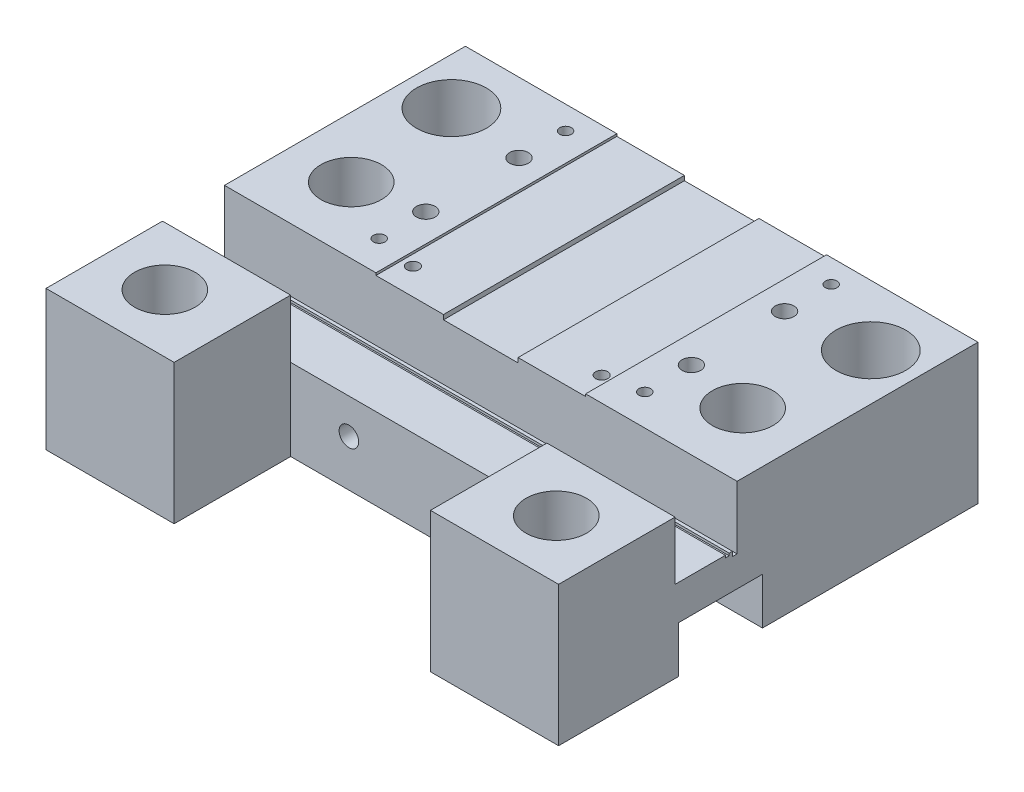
ISO-10303-21;
HEADER;
FILE_DESCRIPTION(('STEP AP214'),'2;1');
FILE_NAME('part.step','',(''),(''),'','','');
FILE_SCHEMA(('AUTOMOTIVE_DESIGN { 1 0 10303 214 1 1 1 1 }'));
ENDSEC;
DATA;
#1=APPLICATION_CONTEXT('core data for automotive mechanical design processes');
#2=APPLICATION_PROTOCOL_DEFINITION('international standard','automotive_design',2000,#1);
#3=PRODUCT_CONTEXT('',#1,'mechanical');
#4=PRODUCT('Part','Part','',(#3));
#5=PRODUCT_RELATED_PRODUCT_CATEGORY('part','',(#4));
#6=PRODUCT_DEFINITION_FORMATION('','',#4);
#7=PRODUCT_DEFINITION_CONTEXT('part definition',#1,'design');
#8=PRODUCT_DEFINITION('design','',#6,#7);
#9=PRODUCT_DEFINITION_SHAPE('','',#8);
#10=(LENGTH_UNIT() NAMED_UNIT(*) SI_UNIT(.MILLI.,.METRE.));
#11=(NAMED_UNIT(*) PLANE_ANGLE_UNIT() SI_UNIT($,.RADIAN.));
#12=(NAMED_UNIT(*) SI_UNIT($,.STERADIAN.) SOLID_ANGLE_UNIT());
#13=UNCERTAINTY_MEASURE_WITH_UNIT(LENGTH_MEASURE(1.E-05),#10,'distance_accuracy_value','');
#14=(GEOMETRIC_REPRESENTATION_CONTEXT(3) GLOBAL_UNCERTAINTY_ASSIGNED_CONTEXT((#13)) GLOBAL_UNIT_ASSIGNED_CONTEXT((#10,
#11,#12)) REPRESENTATION_CONTEXT('',''));
#15=CARTESIAN_POINT('',(0.,0.,0.));
#16=DIRECTION('',(0.,0.,1.));
#17=DIRECTION('',(1.,0.,0.));
#18=AXIS2_PLACEMENT_3D('',#15,#16,#17);
#19=CARTESIAN_POINT('',(77.5000000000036,30.,90.));
#20=DIRECTION('',(0.,-1.,0.));
#21=DIRECTION('',(0.,0.,-1.));
#22=AXIS2_PLACEMENT_3D('',#19,#20,#21);
#23=PLANE('',#22);
#24=CARTESIAN_POINT('',(97.,30.,77.5));
#25=DIRECTION('',(0.,1.,0.));
#26=DIRECTION('',(0.,0.,1.));
#27=AXIS2_PLACEMENT_3D('',#24,#25,#26);
#28=CIRCLE('',#27,6.50000000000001);
#29=CARTESIAN_POINT('',(97.,30.,84.));
#30=VERTEX_POINT('',#29);
#31=EDGE_CURVE('E467',#30,#30,#28,.T.);
#32=ORIENTED_EDGE('',*,*,#31,.F.);
#33=EDGE_LOOP('',(#32));
#34=FACE_BOUND('',#33,.T.);
#35=DIRECTION('',(0.,0.,-1.));
#36=VECTOR('',#35,1.);
#37=CARTESIAN_POINT('',(82.5,30.,90.));
#38=LINE('',#37,#36);
#39=CARTESIAN_POINT('',(82.5,30.0000000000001,90.));
#40=VERTEX_POINT('',#39);
#41=CARTESIAN_POINT('',(82.5,29.9999999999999,65.));
#42=VERTEX_POINT('',#41);
#43=EDGE_CURVE('E238',#40,#42,#38,.T.);
#44=ORIENTED_EDGE('',*,*,#43,.F.);
#45=DIRECTION('',(-1.,0.,0.));
#46=VECTOR('',#45,1.);
#47=CARTESIAN_POINT('',(77.5000000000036,30.,90.));
#48=LINE('',#47,#46);
#49=CARTESIAN_POINT('',(110.,30.,90.));
#50=VERTEX_POINT('',#49);
#51=EDGE_CURVE('E313',#50,#40,#48,.T.);
#52=ORIENTED_EDGE('',*,*,#51,.F.);
#53=DIRECTION('',(0.,0.,-1.));
#54=VECTOR('',#53,1.);
#55=CARTESIAN_POINT('',(110.,30.,90.));
#56=LINE('',#55,#54);
#57=CARTESIAN_POINT('',(110.,29.9999999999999,65.));
#58=VERTEX_POINT('',#57);
#59=EDGE_CURVE('E262',#50,#58,#56,.T.);
#60=ORIENTED_EDGE('',*,*,#59,.T.);
#61=DIRECTION('',(1.,0.,0.));
#62=VECTOR('',#61,1.);
#63=CARTESIAN_POINT('',(0.,29.9999999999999,65.));
#64=LINE('',#63,#62);
#65=EDGE_CURVE('E253',#42,#58,#64,.T.);
#66=ORIENTED_EDGE('',*,*,#65,.F.);
#67=EDGE_LOOP('',(#44,#52,#60,#66));
#68=FACE_BOUND('',#67,.T.);
#69=ADVANCED_FACE('F33',(#34,#68),#23,.F.);
#70=CARTESIAN_POINT('',(0.,30.,90.));
#71=DIRECTION('',(0.,-1.,0.));
#72=DIRECTION('',(0.,0.,-1.));
#73=AXIS2_PLACEMENT_3D('',#70,#71,#72);
#74=PLANE('',#73);
#75=CARTESIAN_POINT('',(13.,30.,77.5));
#76=DIRECTION('',(0.,1.,0.));
#77=DIRECTION('',(0.,0.,1.));
#78=AXIS2_PLACEMENT_3D('',#75,#76,#77);
#79=CIRCLE('',#78,6.5);
#80=CARTESIAN_POINT('',(13.,30.,84.));
#81=VERTEX_POINT('',#80);
#82=EDGE_CURVE('E464',#81,#81,#79,.T.);
#83=ORIENTED_EDGE('',*,*,#82,.F.);
#84=EDGE_LOOP('',(#83));
#85=FACE_BOUND('',#84,.T.);
#86=DIRECTION('',(0.,0.,1.));
#87=VECTOR('',#86,1.);
#88=CARTESIAN_POINT('',(27.5,30.,90.));
#89=LINE('',#88,#87);
#90=CARTESIAN_POINT('',(27.5,30.,65.));
#91=VERTEX_POINT('',#90);
#92=CARTESIAN_POINT('',(27.5,30.0000000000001,90.));
#93=VERTEX_POINT('',#92);
#94=EDGE_CURVE('E678',#91,#93,#89,.T.);
#95=ORIENTED_EDGE('',*,*,#94,.F.);
#96=CARTESIAN_POINT('',(0.,29.9999999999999,65.));
#97=VERTEX_POINT('',#96);
#98=EDGE_CURVE('E263',#97,#91,#64,.T.);
#99=ORIENTED_EDGE('',*,*,#98,.F.);
#100=DIRECTION('',(0.,0.,-1.));
#101=VECTOR('',#100,1.);
#102=CARTESIAN_POINT('',(0.,30.,90.));
#103=LINE('',#102,#101);
#104=CARTESIAN_POINT('',(0.,30.,90.));
#105=VERTEX_POINT('',#104);
#106=EDGE_CURVE('E357',#105,#97,#103,.T.);
#107=ORIENTED_EDGE('',*,*,#106,.F.);
#108=DIRECTION('',(-1.,0.,0.));
#109=VECTOR('',#108,1.);
#110=CARTESIAN_POINT('',(0.,30.,90.));
#111=LINE('',#110,#109);
#112=EDGE_CURVE('E315',#93,#105,#111,.T.);
#113=ORIENTED_EDGE('',*,*,#112,.F.);
#114=EDGE_LOOP('',(#95,#99,#107,#113));
#115=FACE_BOUND('',#114,.T.);
#116=ADVANCED_FACE('F677',(#85,#115),#74,.F.);
#117=CARTESIAN_POINT('',(0.,-1.13686837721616E-13,90.));
#118=DIRECTION('',(0.,1.,0.));
#119=DIRECTION('',(-1.,0.,0.));
#120=AXIS2_PLACEMENT_3D('',#117,#118,#119);
#121=PLANE('',#120);
#122=CARTESIAN_POINT('',(10.,-2.28983498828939E-13,13.));
#123=DIRECTION('',(0.,1.,0.));
#124=DIRECTION('',(0.,0.,1.));
#125=AXIS2_PLACEMENT_3D('',#122,#123,#124);
#126=CIRCLE('',#125,7.5);
#127=CARTESIAN_POINT('',(10.,-2.28983498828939E-13,20.5));
#128=VERTEX_POINT('',#127);
#129=EDGE_CURVE('E453',#128,#128,#126,.T.);
#130=ORIENTED_EDGE('',*,*,#129,.T.);
#131=EDGE_LOOP('',(#130));
#132=FACE_BOUND('',#131,.T.);
#133=CARTESIAN_POINT('',(100.,-2.28983498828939E-13,13.));
#134=DIRECTION('',(0.,1.,0.));
#135=DIRECTION('',(0.,0.,1.));
#136=AXIS2_PLACEMENT_3D('',#133,#134,#135);
#137=CIRCLE('',#136,7.50000000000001);
#138=CARTESIAN_POINT('',(100.,-2.28983498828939E-13,20.5));
#139=VERTEX_POINT('',#138);
#140=EDGE_CURVE('E447',#139,#139,#137,.T.);
#141=ORIENTED_EDGE('',*,*,#140,.T.);
#142=EDGE_LOOP('',(#141));
#143=FACE_BOUND('',#142,.T.);
#144=CARTESIAN_POINT('',(13.,0.,77.5));
#145=DIRECTION('',(0.,-1.,0.));
#146=DIRECTION('',(1.,0.,0.));
#147=AXIS2_PLACEMENT_3D('',#144,#145,#146);
#148=CIRCLE('',#147,8.25);
#149=CARTESIAN_POINT('',(21.25,0.,77.5));
#150=VERTEX_POINT('',#149);
#151=EDGE_CURVE('E386',#150,#150,#148,.T.);
#152=ORIENTED_EDGE('',*,*,#151,.F.);
#153=EDGE_LOOP('',(#152));
#154=FACE_BOUND('',#153,.T.);
#155=CARTESIAN_POINT('',(13.,0.,37.5));
#156=DIRECTION('',(0.,-1.,0.));
#157=DIRECTION('',(1.,0.,0.));
#158=AXIS2_PLACEMENT_3D('',#155,#156,#157);
#159=CIRCLE('',#158,8.25);
#160=CARTESIAN_POINT('',(21.25,0.,37.5));
#161=VERTEX_POINT('',#160);
#162=EDGE_CURVE('E391',#161,#161,#159,.T.);
#163=ORIENTED_EDGE('',*,*,#162,.F.);
#164=EDGE_LOOP('',(#163));
#165=FACE_BOUND('',#164,.T.);
#166=CARTESIAN_POINT('',(97.,-1.00251120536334E-13,37.5));
#167=DIRECTION('',(0.,-1.,0.));
#168=DIRECTION('',(1.,0.,0.));
#169=AXIS2_PLACEMENT_3D('',#166,#167,#168);
#170=CIRCLE('',#169,8.25000000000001);
#171=CARTESIAN_POINT('',(105.25,-1.08777633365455E-13,37.5));
#172=VERTEX_POINT('',#171);
#173=EDGE_CURVE('E396',#172,#172,#170,.T.);
#174=ORIENTED_EDGE('',*,*,#173,.F.);
#175=EDGE_LOOP('',(#174));
#176=FACE_BOUND('',#175,.T.);
#177=CARTESIAN_POINT('',(97.,-1.00251120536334E-13,77.5));
#178=DIRECTION('',(0.,-1.,0.));
#179=DIRECTION('',(1.,0.,0.));
#180=AXIS2_PLACEMENT_3D('',#177,#178,#179);
#181=CIRCLE('',#180,8.25000000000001);
#182=CARTESIAN_POINT('',(105.25,-1.08777633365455E-13,77.5));
#183=VERTEX_POINT('',#182);
#184=EDGE_CURVE('E401',#183,#183,#181,.T.);
#185=ORIENTED_EDGE('',*,*,#184,.F.);
#186=EDGE_LOOP('',(#185));
#187=FACE_BOUND('',#186,.T.);
#188=CARTESIAN_POINT('',(34.7500000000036,-2.28983498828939E-13,46.0120402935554));
#189=DIRECTION('',(0.,1.,0.));
#190=DIRECTION('',(0.,0.,1.));
#191=AXIS2_PLACEMENT_3D('',#188,#189,#190);
#192=CIRCLE('',#191,1.3);
#193=CARTESIAN_POINT('',(34.7500000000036,-2.28983498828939E-13,47.3120402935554));
#194=VERTEX_POINT('',#193);
#195=EDGE_CURVE('E423',#194,#194,#192,.T.);
#196=ORIENTED_EDGE('',*,*,#195,.T.);
#197=EDGE_LOOP('',(#196));
#198=FACE_BOUND('',#197,.T.);
#199=CARTESIAN_POINT('',(75.2500000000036,-2.28983498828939E-13,46.0120402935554));
#200=DIRECTION('',(0.,1.,0.));
#201=DIRECTION('',(0.,0.,1.));
#202=AXIS2_PLACEMENT_3D('',#199,#200,#201);
#203=CIRCLE('',#202,1.3);
#204=CARTESIAN_POINT('',(75.2500000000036,-2.28983498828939E-13,47.3120402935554));
#205=VERTEX_POINT('',#204);
#206=EDGE_CURVE('E577',#205,#205,#203,.T.);
#207=ORIENTED_EDGE('',*,*,#206,.T.);
#208=EDGE_LOOP('',(#207));
#209=FACE_BOUND('',#208,.T.);
#210=CARTESIAN_POINT('',(26.5000000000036,-2.28983498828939E-13,15.));
#211=DIRECTION('',(0.,1.,0.));
#212=DIRECTION('',(0.,0.,1.));
#213=AXIS2_PLACEMENT_3D('',#210,#211,#212);
#214=CIRCLE('',#213,2.00000000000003);
#215=CARTESIAN_POINT('',(26.5000000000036,-2.28983498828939E-13,17.));
#216=VERTEX_POINT('',#215);
#217=EDGE_CURVE('E574',#216,#216,#214,.T.);
#218=ORIENTED_EDGE('',*,*,#217,.T.);
#219=EDGE_LOOP('',(#218));
#220=FACE_BOUND('',#219,.T.);
#221=CARTESIAN_POINT('',(83.4999999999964,-2.28983498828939E-13,15.));
#222=DIRECTION('',(0.,1.,0.));
#223=DIRECTION('',(0.,0.,1.));
#224=AXIS2_PLACEMENT_3D('',#221,#222,#223);
#225=CIRCLE('',#224,2.00000000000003);
#226=CARTESIAN_POINT('',(83.4999999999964,-2.28983498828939E-13,17.));
#227=VERTEX_POINT('',#226);
#228=EDGE_CURVE('E568',#227,#227,#225,.T.);
#229=ORIENTED_EDGE('',*,*,#228,.T.);
#230=EDGE_LOOP('',(#229));
#231=FACE_BOUND('',#230,.T.);
#232=CARTESIAN_POINT('',(83.4999999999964,-2.28983498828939E-13,35.));
#233=DIRECTION('',(0.,1.,0.));
#234=DIRECTION('',(0.,0.,1.));
#235=AXIS2_PLACEMENT_3D('',#232,#233,#234);
#236=CIRCLE('',#235,2.00000000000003);
#237=CARTESIAN_POINT('',(83.4999999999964,-2.28983498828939E-13,37.));
#238=VERTEX_POINT('',#237);
#239=EDGE_CURVE('E562',#238,#238,#236,.T.);
#240=ORIENTED_EDGE('',*,*,#239,.T.);
#241=EDGE_LOOP('',(#240));
#242=FACE_BOUND('',#241,.T.);
#243=CARTESIAN_POINT('',(26.5000000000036,-2.28983498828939E-13,35.));
#244=DIRECTION('',(0.,1.,0.));
#245=DIRECTION('',(0.,0.,1.));
#246=AXIS2_PLACEMENT_3D('',#243,#244,#245);
#247=CIRCLE('',#246,2.00000000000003);
#248=CARTESIAN_POINT('',(26.5000000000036,-2.28983498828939E-13,37.));
#249=VERTEX_POINT('',#248);
#250=EDGE_CURVE('E556',#249,#249,#247,.T.);
#251=ORIENTED_EDGE('',*,*,#250,.T.);
#252=EDGE_LOOP('',(#251));
#253=FACE_BOUND('',#252,.T.);
#254=CARTESIAN_POINT('',(13.,0.,60.));
#255=DIRECTION('',(0.,-1.,0.));
#256=DIRECTION('',(1.,0.,0.));
#257=AXIS2_PLACEMENT_3D('',#254,#255,#256);
#258=CIRCLE('',#257,2.5);
#259=CARTESIAN_POINT('',(15.5,0.,60.));
#260=VERTEX_POINT('',#259);
#261=EDGE_CURVE('E549',#260,#260,#258,.T.);
#262=ORIENTED_EDGE('',*,*,#261,.F.);
#263=EDGE_LOOP('',(#262));
#264=FACE_BOUND('',#263,.T.);
#265=CARTESIAN_POINT('',(26.5000000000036,0.,25.));
#266=DIRECTION('',(0.,-1.,0.));
#267=DIRECTION('',(1.,0.,0.));
#268=AXIS2_PLACEMENT_3D('',#265,#266,#267);
#269=CIRCLE('',#268,2.5);
#270=CARTESIAN_POINT('',(29.0000000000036,0.,25.));
#271=VERTEX_POINT('',#270);
#272=EDGE_CURVE('E1354',#271,#271,#269,.T.);
#273=ORIENTED_EDGE('',*,*,#272,.F.);
#274=EDGE_LOOP('',(#273));
#275=FACE_BOUND('',#274,.T.);
#276=CARTESIAN_POINT('',(83.4999999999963,0.,25.));
#277=DIRECTION('',(0.,-1.,0.));
#278=DIRECTION('',(1.,0.,0.));
#279=AXIS2_PLACEMENT_3D('',#276,#277,#278);
#280=CIRCLE('',#279,2.49999999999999);
#281=CARTESIAN_POINT('',(85.9999999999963,0.,25.));
#282=VERTEX_POINT('',#281);
#283=EDGE_CURVE('E1350',#282,#282,#280,.T.);
#284=ORIENTED_EDGE('',*,*,#283,.F.);
#285=EDGE_LOOP('',(#284));
#286=FACE_BOUND('',#285,.T.);
#287=DIRECTION('',(0.,0.,-1.));
#288=VECTOR('',#287,1.);
#289=CARTESIAN_POINT('',(27.5,-1.4210854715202E-13,90.));
#290=LINE('',#289,#288);
#291=CARTESIAN_POINT('',(27.5,-1.66533453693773E-13,90.));
#292=VERTEX_POINT('',#291);
#293=CARTESIAN_POINT('',(27.5,-1.11022302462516E-13,65.));
#294=VERTEX_POINT('',#293);
#295=EDGE_CURVE('E246',#292,#294,#290,.T.);
#296=ORIENTED_EDGE('',*,*,#295,.F.);
#297=DIRECTION('',(1.,0.,0.));
#298=VECTOR('',#297,1.);
#299=CARTESIAN_POINT('',(0.,-1.13686837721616E-13,90.));
#300=LINE('',#299,#298);
#301=CARTESIAN_POINT('',(0.,-1.13686837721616E-13,90.));
#302=VERTEX_POINT('',#301);
#303=EDGE_CURVE('E307',#302,#292,#300,.T.);
#304=ORIENTED_EDGE('',*,*,#303,.F.);
#305=DIRECTION('',(0.,0.,-1.));
#306=VECTOR('',#305,1.);
#307=CARTESIAN_POINT('',(0.,-1.13686837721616E-13,90.));
#308=LINE('',#307,#306);
#309=CARTESIAN_POINT('',(0.,-1.13686837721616E-13,0.));
#310=VERTEX_POINT('',#309);
#311=EDGE_CURVE('E319',#302,#310,#308,.T.);
#312=ORIENTED_EDGE('',*,*,#311,.T.);
#313=DIRECTION('',(1.,0.,0.));
#314=VECTOR('',#313,1.);
#315=CARTESIAN_POINT('',(0.,-1.13686837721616E-13,0.));
#316=LINE('',#315,#314);
#317=CARTESIAN_POINT('',(110.,-2.27373675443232E-13,0.));
#318=VERTEX_POINT('',#317);
#319=EDGE_CURVE('E306',#310,#318,#316,.T.);
#320=ORIENTED_EDGE('',*,*,#319,.T.);
#321=DIRECTION('',(0.,0.,-1.));
#322=VECTOR('',#321,1.);
#323=CARTESIAN_POINT('',(110.,-2.27373675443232E-13,90.));
#324=LINE('',#323,#322);
#325=CARTESIAN_POINT('',(110.,-1.13686837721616E-13,46.25));
#326=VERTEX_POINT('',#325);
#327=EDGE_CURVE('E42',#326,#318,#324,.T.);
#328=ORIENTED_EDGE('',*,*,#327,.F.);
#329=DIRECTION('',(1.,0.,0.));
#330=VECTOR('',#329,1.);
#331=CARTESIAN_POINT('',(110.,-1.13686837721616E-13,46.25));
#332=LINE('',#331,#330);
#333=CARTESIAN_POINT('',(90.,0.,46.25));
#334=VERTEX_POINT('',#333);
#335=EDGE_CURVE('E1364',#334,#326,#332,.T.);
#336=ORIENTED_EDGE('',*,*,#335,.F.);
#337=CARTESIAN_POINT('',(90.,0.,55.25));
#338=DIRECTION('',(0.,-1.,0.));
#339=DIRECTION('',(1.,0.,0.));
#340=AXIS2_PLACEMENT_3D('',#337,#338,#339);
#341=CIRCLE('',#340,9.);
#342=CARTESIAN_POINT('',(90.,0.,64.25));
#343=VERTEX_POINT('',#342);
#344=EDGE_CURVE('E1370',#343,#334,#341,.T.);
#345=ORIENTED_EDGE('',*,*,#344,.F.);
#346=DIRECTION('',(-1.,0.,0.));
#347=VECTOR('',#346,1.);
#348=CARTESIAN_POINT('',(110.,-1.13686837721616E-13,64.25));
#349=LINE('',#348,#347);
#350=CARTESIAN_POINT('',(110.,-2.27373675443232E-13,64.25));
#351=VERTEX_POINT('',#350);
#352=EDGE_CURVE('E532',#351,#343,#349,.T.);
#353=ORIENTED_EDGE('',*,*,#352,.F.);
#354=CARTESIAN_POINT('',(110.,-2.27373675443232E-13,90.));
#355=VERTEX_POINT('',#354);
#356=EDGE_CURVE('E12',#355,#351,#324,.T.);
#357=ORIENTED_EDGE('',*,*,#356,.F.);
#358=CARTESIAN_POINT('',(82.5,-1.66533453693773E-13,90.));
#359=VERTEX_POINT('',#358);
#360=EDGE_CURVE('E311',#359,#355,#300,.T.);
#361=ORIENTED_EDGE('',*,*,#360,.F.);
#362=DIRECTION('',(0.,0.,1.));
#363=VECTOR('',#362,1.);
#364=CARTESIAN_POINT('',(82.5,-1.98951966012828E-13,90.));
#365=LINE('',#364,#363);
#366=CARTESIAN_POINT('',(82.5,-1.38777878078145E-13,65.));
#367=VERTEX_POINT('',#366);
#368=EDGE_CURVE('E247',#367,#359,#365,.T.);
#369=ORIENTED_EDGE('',*,*,#368,.F.);
#370=DIRECTION('',(1.,0.,0.));
#371=VECTOR('',#370,1.);
#372=CARTESIAN_POINT('',(0.,-1.13686837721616E-13,65.));
#373=LINE('',#372,#371);
#374=EDGE_CURVE('E1345',#294,#367,#373,.T.);
#375=ORIENTED_EDGE('',*,*,#374,.F.);
#376=EDGE_LOOP('',(#296,#304,#312,#320,#328,#336,#345,#353,#357,#361,#369,#375));
#377=FACE_BOUND('',#376,.T.);
#378=ADVANCED_FACE('F35',(#132,#143,#154,#165,#176,#187,#198,#209,#220,#231,#242,#253,#264,#275,
#286,#377),#121,.F.);
#379=CARTESIAN_POINT('',(110.,-2.27373675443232E-13,90.));
#380=DIRECTION('',(0.,0.,1.));
#381=DIRECTION('',(1.,0.,0.));
#382=AXIS2_PLACEMENT_3D('',#379,#380,#381);
#383=PLANE('',#382);
#384=ORIENTED_EDGE('',*,*,#303,.T.);
#385=DIRECTION('',(0.,-1.,0.));
#386=VECTOR('',#385,1.);
#387=CARTESIAN_POINT('',(27.5,211.572988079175,90.));
#388=LINE('',#387,#386);
#389=EDGE_CURVE('E673',#93,#292,#388,.T.);
#390=ORIENTED_EDGE('',*,*,#389,.F.);
#391=ORIENTED_EDGE('',*,*,#112,.T.);
#392=DIRECTION('',(0.,-1.,0.));
#393=VECTOR('',#392,1.);
#394=CARTESIAN_POINT('',(0.,-1.13686837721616E-13,90.));
#395=LINE('',#394,#393);
#396=EDGE_CURVE('E317',#105,#302,#395,.T.);
#397=ORIENTED_EDGE('',*,*,#396,.T.);
#398=EDGE_LOOP('',(#384,#390,#391,#397));
#399=FACE_BOUND('',#398,.T.);
#400=ADVANCED_FACE('F670',(#399),#383,.T.);
#401=ORIENTED_EDGE('',*,*,#51,.T.);
#402=DIRECTION('',(0.,-1.,0.));
#403=VECTOR('',#402,1.);
#404=CARTESIAN_POINT('',(82.5,211.572988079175,90.));
#405=LINE('',#404,#403);
#406=EDGE_CURVE('E241',#40,#359,#405,.T.);
#407=ORIENTED_EDGE('',*,*,#406,.T.);
#408=ORIENTED_EDGE('',*,*,#360,.T.);
#409=DIRECTION('',(0.,1.,0.));
#410=VECTOR('',#409,1.);
#411=CARTESIAN_POINT('',(110.,-2.27373675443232E-13,90.));
#412=LINE('',#411,#410);
#413=EDGE_CURVE('E310',#355,#50,#412,.T.);
#414=ORIENTED_EDGE('',*,*,#413,.T.);
#415=EDGE_LOOP('',(#401,#407,#408,#414));
#416=FACE_BOUND('',#415,.T.);
#417=ADVANCED_FACE('F525',(#416),#383,.T.);
#418=CARTESIAN_POINT('',(0.,17.4999999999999,65.));
#419=DIRECTION('',(0.,0.,-1.));
#420=DIRECTION('',(-1.,0.,0.));
#421=AXIS2_PLACEMENT_3D('',#418,#419,#420);
#422=PLANE('',#421);
#423=ORIENTED_EDGE('',*,*,#98,.T.);
#424=DIRECTION('',(0.,-1.,0.));
#425=VECTOR('',#424,1.);
#426=CARTESIAN_POINT('',(27.5,211.572988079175,65.));
#427=LINE('',#426,#425);
#428=CARTESIAN_POINT('',(27.5,17.4999999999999,65.));
#429=VERTEX_POINT('',#428);
#430=EDGE_CURVE('E682',#91,#429,#427,.T.);
#431=ORIENTED_EDGE('',*,*,#430,.T.);
#432=DIRECTION('',(1.,0.,0.));
#433=VECTOR('',#432,1.);
#434=CARTESIAN_POINT('',(0.,17.4999999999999,65.));
#435=LINE('',#434,#433);
#436=CARTESIAN_POINT('',(0.,17.4999999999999,65.));
#437=VERTEX_POINT('',#436);
#438=EDGE_CURVE('E264',#437,#429,#435,.T.);
#439=ORIENTED_EDGE('',*,*,#438,.F.);
#440=DIRECTION('',(0.,1.,0.));
#441=VECTOR('',#440,1.);
#442=CARTESIAN_POINT('',(0.,17.4999999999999,65.));
#443=LINE('',#442,#441);
#444=EDGE_CURVE('E495',#437,#97,#443,.T.);
#445=ORIENTED_EDGE('',*,*,#444,.T.);
#446=EDGE_LOOP('',(#423,#431,#439,#445));
#447=FACE_BOUND('',#446,.T.);
#448=ADVANCED_FACE('F681',(#447),#422,.T.);
#449=CARTESIAN_POINT('',(82.5,17.4999999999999,65.));
#450=VERTEX_POINT('',#449);
#451=CARTESIAN_POINT('',(110.,17.4999999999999,65.));
#452=VERTEX_POINT('',#451);
#453=EDGE_CURVE('E255',#450,#452,#435,.T.);
#454=ORIENTED_EDGE('',*,*,#453,.F.);
#455=DIRECTION('',(0.,-1.,0.));
#456=VECTOR('',#455,1.);
#457=CARTESIAN_POINT('',(82.5,211.572988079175,65.));
#458=LINE('',#457,#456);
#459=EDGE_CURVE('E50',#42,#450,#458,.T.);
#460=ORIENTED_EDGE('',*,*,#459,.F.);
#461=ORIENTED_EDGE('',*,*,#65,.T.);
#462=DIRECTION('',(0.,1.,0.));
#463=VECTOR('',#462,1.);
#464=CARTESIAN_POINT('',(110.,17.4999999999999,65.));
#465=LINE('',#464,#463);
#466=EDGE_CURVE('E272',#452,#58,#465,.T.);
#467=ORIENTED_EDGE('',*,*,#466,.F.);
#468=EDGE_LOOP('',(#454,#460,#461,#467));
#469=FACE_BOUND('',#468,.T.);
#470=ADVANCED_FACE('F251',(#469),#422,.T.);
#471=CARTESIAN_POINT('',(26.5000000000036,30.,35.));
#472=DIRECTION('',(0.,1.,0.));
#473=DIRECTION('',(0.,0.,1.));
#474=AXIS2_PLACEMENT_3D('',#471,#472,#473);
#475=CIRCLE('',#474,2.00000000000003);
#476=CARTESIAN_POINT('',(26.5000000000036,30.,37.));
#477=VERTEX_POINT('',#476);
#478=EDGE_CURVE('E553',#477,#477,#475,.T.);
#479=ORIENTED_EDGE('',*,*,#478,.F.);
#480=EDGE_LOOP('',(#479));
#481=FACE_BOUND('',#480,.T.);
#482=CARTESIAN_POINT('',(26.5000000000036,30.,15.));
#483=DIRECTION('',(0.,1.,0.));
#484=DIRECTION('',(0.,0.,1.));
#485=AXIS2_PLACEMENT_3D('',#482,#483,#484);
#486=CIRCLE('',#485,2.00000000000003);
#487=CARTESIAN_POINT('',(26.5000000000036,30.,17.));
#488=VERTEX_POINT('',#487);
#489=EDGE_CURVE('E571',#488,#488,#486,.T.);
#490=ORIENTED_EDGE('',*,*,#489,.F.);
#491=EDGE_LOOP('',(#490));
#492=FACE_BOUND('',#491,.T.);
#493=CARTESIAN_POINT('',(26.5000000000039,30.,5.));
#494=DIRECTION('',(0.,-1.,0.));
#495=DIRECTION('',(0.,0.,-1.));
#496=AXIS2_PLACEMENT_3D('',#493,#494,#495);
#497=CIRCLE('',#496,1.25);
#498=CARTESIAN_POINT('',(26.5000000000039,30.,3.75));
#499=VERTEX_POINT('',#498);
#500=EDGE_CURVE('E398',#499,#499,#497,.F.);
#501=ORIENTED_EDGE('',*,*,#500,.F.);
#502=EDGE_LOOP('',(#501));
#503=FACE_BOUND('',#502,.T.);
#504=CARTESIAN_POINT('',(10.,30.,13.));
#505=DIRECTION('',(0.,1.,0.));
#506=DIRECTION('',(0.,0.,1.));
#507=AXIS2_PLACEMENT_3D('',#504,#505,#506);
#508=CIRCLE('',#507,7.5);
#509=CARTESIAN_POINT('',(10.,30.,20.5));
#510=VERTEX_POINT('',#509);
#511=EDGE_CURVE('E450',#510,#510,#508,.T.);
#512=ORIENTED_EDGE('',*,*,#511,.F.);
#513=EDGE_LOOP('',(#512));
#514=FACE_BOUND('',#513,.T.);
#515=CARTESIAN_POINT('',(13.,30.,37.5));
#516=DIRECTION('',(0.,1.,0.));
#517=DIRECTION('',(0.,0.,1.));
#518=AXIS2_PLACEMENT_3D('',#515,#516,#517);
#519=CIRCLE('',#518,6.5);
#520=CARTESIAN_POINT('',(13.,30.,44.));
#521=VERTEX_POINT('',#520);
#522=EDGE_CURVE('E456',#521,#521,#519,.T.);
#523=ORIENTED_EDGE('',*,*,#522,.F.);
#524=EDGE_LOOP('',(#523));
#525=FACE_BOUND('',#524,.T.);
#526=DIRECTION('',(1.,0.,0.));
#527=VECTOR('',#526,1.);
#528=CARTESIAN_POINT('',(0.,29.9999999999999,51.7000000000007));
#529=LINE('',#528,#527);
#530=CARTESIAN_POINT('',(0.,30.,51.7000000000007));
#531=VERTEX_POINT('',#530);
#532=CARTESIAN_POINT('',(32.5000000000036,29.9999999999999,51.7000000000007));
#533=VERTEX_POINT('',#532);
#534=EDGE_CURVE('E289',#531,#533,#529,.T.);
#535=ORIENTED_EDGE('',*,*,#534,.T.);
#536=DIRECTION('',(0.,0.,-1.));
#537=VECTOR('',#536,1.);
#538=CARTESIAN_POINT('',(32.5000000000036,30.,90.));
#539=LINE('',#538,#537);
#540=CARTESIAN_POINT('',(32.5000000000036,30.,0.));
#541=VERTEX_POINT('',#540);
#542=EDGE_CURVE('E360',#533,#541,#539,.T.);
#543=ORIENTED_EDGE('',*,*,#542,.T.);
#544=DIRECTION('',(-1.,0.,0.));
#545=VECTOR('',#544,1.);
#546=CARTESIAN_POINT('',(0.,30.,0.));
#547=LINE('',#546,#545);
#548=CARTESIAN_POINT('',(0.,30.,0.));
#549=VERTEX_POINT('',#548);
#550=EDGE_CURVE('E349',#541,#549,#547,.T.);
#551=ORIENTED_EDGE('',*,*,#550,.T.);
#552=EDGE_CURVE('E356',#531,#549,#103,.T.);
#553=ORIENTED_EDGE('',*,*,#552,.F.);
#554=EDGE_LOOP('',(#535,#543,#551,#553));
#555=FACE_BOUND('',#554,.T.);
#556=CARTESIAN_POINT('',(26.5000000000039,30.,45.));
#557=DIRECTION('',(0.,-1.,0.));
#558=DIRECTION('',(0.,0.,-1.));
#559=AXIS2_PLACEMENT_3D('',#556,#557,#558);
#560=CIRCLE('',#559,1.25);
#561=CARTESIAN_POINT('',(26.5000000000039,30.,43.75));
#562=VERTEX_POINT('',#561);
#563=EDGE_CURVE('E410',#562,#562,#560,.F.);
#564=ORIENTED_EDGE('',*,*,#563,.F.);
#565=EDGE_LOOP('',(#564));
#566=FACE_BOUND('',#565,.T.);
#567=ADVANCED_FACE('F626',(#481,#492,#503,#514,#525,#555,#566),#74,.F.);
#568=CARTESIAN_POINT('',(83.4999999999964,30.,35.));
#569=DIRECTION('',(0.,1.,0.));
#570=DIRECTION('',(0.,0.,1.));
#571=AXIS2_PLACEMENT_3D('',#568,#569,#570);
#572=CIRCLE('',#571,2.00000000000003);
#573=CARTESIAN_POINT('',(83.4999999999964,30.,37.));
#574=VERTEX_POINT('',#573);
#575=EDGE_CURVE('E559',#574,#574,#572,.T.);
#576=ORIENTED_EDGE('',*,*,#575,.F.);
#577=EDGE_LOOP('',(#576));
#578=FACE_BOUND('',#577,.T.);
#579=CARTESIAN_POINT('',(83.4999999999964,30.,15.));
#580=DIRECTION('',(0.,1.,0.));
#581=DIRECTION('',(0.,0.,1.));
#582=AXIS2_PLACEMENT_3D('',#579,#580,#581);
#583=CIRCLE('',#582,2.00000000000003);
#584=CARTESIAN_POINT('',(83.4999999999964,30.,17.));
#585=VERTEX_POINT('',#584);
#586=EDGE_CURVE('E565',#585,#585,#583,.T.);
#587=ORIENTED_EDGE('',*,*,#586,.F.);
#588=EDGE_LOOP('',(#587));
#589=FACE_BOUND('',#588,.T.);
#590=CARTESIAN_POINT('',(83.4999999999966,30.,5.));
#591=DIRECTION('',(0.,-1.,0.));
#592=DIRECTION('',(0.,0.,-1.));
#593=AXIS2_PLACEMENT_3D('',#590,#591,#592);
#594=CIRCLE('',#593,1.25);
#595=CARTESIAN_POINT('',(83.4999999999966,30.,3.75));
#596=VERTEX_POINT('',#595);
#597=EDGE_CURVE('E403',#596,#596,#594,.F.);
#598=ORIENTED_EDGE('',*,*,#597,.F.);
#599=EDGE_LOOP('',(#598));
#600=FACE_BOUND('',#599,.T.);
#601=CARTESIAN_POINT('',(100.,30.,13.));
#602=DIRECTION('',(0.,1.,0.));
#603=DIRECTION('',(0.,0.,1.));
#604=AXIS2_PLACEMENT_3D('',#601,#602,#603);
#605=CIRCLE('',#604,7.50000000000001);
#606=CARTESIAN_POINT('',(100.,30.,20.5));
#607=VERTEX_POINT('',#606);
#608=EDGE_CURVE('E381',#607,#607,#605,.T.);
#609=ORIENTED_EDGE('',*,*,#608,.F.);
#610=EDGE_LOOP('',(#609));
#611=FACE_BOUND('',#610,.T.);
#612=CARTESIAN_POINT('',(97.,30.,37.5));
#613=DIRECTION('',(0.,1.,0.));
#614=DIRECTION('',(0.,0.,1.));
#615=AXIS2_PLACEMENT_3D('',#612,#613,#614);
#616=CIRCLE('',#615,6.50000000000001);
#617=CARTESIAN_POINT('',(97.,30.,44.));
#618=VERTEX_POINT('',#617);
#619=EDGE_CURVE('E461',#618,#618,#616,.T.);
#620=ORIENTED_EDGE('',*,*,#619,.F.);
#621=EDGE_LOOP('',(#620));
#622=FACE_BOUND('',#621,.T.);
#623=CARTESIAN_POINT('',(77.5000000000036,29.9999999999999,51.7000000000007));
#624=VERTEX_POINT('',#623);
#625=CARTESIAN_POINT('',(110.,29.9999999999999,51.7000000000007));
#626=VERTEX_POINT('',#625);
#627=EDGE_CURVE('E292',#624,#626,#529,.T.);
#628=ORIENTED_EDGE('',*,*,#627,.T.);
#629=CARTESIAN_POINT('',(110.,30.,0.));
#630=VERTEX_POINT('',#629);
#631=EDGE_CURVE('E376',#626,#630,#56,.T.);
#632=ORIENTED_EDGE('',*,*,#631,.T.);
#633=DIRECTION('',(-1.,0.,0.));
#634=VECTOR('',#633,1.);
#635=CARTESIAN_POINT('',(77.5000000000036,30.,0.));
#636=LINE('',#635,#634);
#637=CARTESIAN_POINT('',(77.5000000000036,30.,0.));
#638=VERTEX_POINT('',#637);
#639=EDGE_CURVE('E325',#630,#638,#636,.T.);
#640=ORIENTED_EDGE('',*,*,#639,.T.);
#641=DIRECTION('',(0.,0.,-1.));
#642=VECTOR('',#641,1.);
#643=CARTESIAN_POINT('',(77.5000000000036,30.,90.));
#644=LINE('',#643,#642);
#645=EDGE_CURVE('E374',#624,#638,#644,.T.);
#646=ORIENTED_EDGE('',*,*,#645,.F.);
#647=EDGE_LOOP('',(#628,#632,#640,#646));
#648=FACE_BOUND('',#647,.T.);
#649=CARTESIAN_POINT('',(83.4999999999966,30.,45.));
#650=DIRECTION('',(0.,-1.,0.));
#651=DIRECTION('',(0.,0.,-1.));
#652=AXIS2_PLACEMENT_3D('',#649,#650,#651);
#653=CIRCLE('',#652,1.25);
#654=CARTESIAN_POINT('',(83.4999999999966,30.,43.75));
#655=VERTEX_POINT('',#654);
#656=EDGE_CURVE('E407',#655,#655,#653,.F.);
#657=ORIENTED_EDGE('',*,*,#656,.F.);
#658=EDGE_LOOP('',(#657));
#659=FACE_BOUND('',#658,.T.);
#660=ADVANCED_FACE('F643',(#578,#589,#600,#611,#622,#648,#659),#23,.F.);
#661=CARTESIAN_POINT('',(97.,-2.28983498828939E-13,77.5));
#662=DIRECTION('',(0.,1.,0.));
#663=DIRECTION('',(0.,0.,1.));
#664=AXIS2_PLACEMENT_3D('',#661,#662,#663);
#665=CYLINDRICAL_SURFACE('',#664,6.50000000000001);
#666=ORIENTED_EDGE('',*,*,#31,.T.);
#667=EDGE_LOOP('',(#666));
#668=FACE_BOUND('',#667,.T.);
#669=CARTESIAN_POINT('',(97.,5.4999999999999,77.5));
#670=DIRECTION('',(0.,-1.,0.));
#671=DIRECTION('',(1.,0.,0.));
#672=AXIS2_PLACEMENT_3D('',#669,#670,#671);
#673=CIRCLE('',#672,6.50000000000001);
#674=CARTESIAN_POINT('',(103.5,5.49999999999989,77.5));
#675=VERTEX_POINT('',#674);
#676=EDGE_CURVE('E393',#675,#675,#673,.F.);
#677=ORIENTED_EDGE('',*,*,#676,.F.);
#678=EDGE_LOOP('',(#677));
#679=FACE_BOUND('',#678,.T.);
#680=ADVANCED_FACE('F724',(#668,#679),#665,.F.);
#681=CARTESIAN_POINT('',(97.,-2.28983498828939E-13,37.5));
#682=DIRECTION('',(0.,1.,0.));
#683=DIRECTION('',(0.,0.,1.));
#684=AXIS2_PLACEMENT_3D('',#681,#682,#683);
#685=CYLINDRICAL_SURFACE('',#684,6.50000000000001);
#686=ORIENTED_EDGE('',*,*,#619,.T.);
#687=EDGE_LOOP('',(#686));
#688=FACE_BOUND('',#687,.T.);
#689=CARTESIAN_POINT('',(97.,5.4999999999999,37.5));
#690=DIRECTION('',(0.,-1.,0.));
#691=DIRECTION('',(1.,0.,0.));
#692=AXIS2_PLACEMENT_3D('',#689,#690,#691);
#693=CIRCLE('',#692,6.50000000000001);
#694=CARTESIAN_POINT('',(103.5,5.49999999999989,37.5));
#695=VERTEX_POINT('',#694);
#696=EDGE_CURVE('E388',#695,#695,#693,.F.);
#697=ORIENTED_EDGE('',*,*,#696,.F.);
#698=EDGE_LOOP('',(#697));
#699=FACE_BOUND('',#698,.T.);
#700=ADVANCED_FACE('F730',(#688,#699),#685,.F.);
#701=CARTESIAN_POINT('',(13.,-2.28983498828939E-13,37.5));
#702=DIRECTION('',(0.,1.,0.));
#703=DIRECTION('',(0.,0.,1.));
#704=AXIS2_PLACEMENT_3D('',#701,#702,#703);
#705=CYLINDRICAL_SURFACE('',#704,6.5);
#706=ORIENTED_EDGE('',*,*,#522,.T.);
#707=EDGE_LOOP('',(#706));
#708=FACE_BOUND('',#707,.T.);
#709=CARTESIAN_POINT('',(13.,5.49999999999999,37.5));
#710=DIRECTION('',(0.,-1.,0.));
#711=DIRECTION('',(1.,0.,0.));
#712=AXIS2_PLACEMENT_3D('',#709,#710,#711);
#713=CIRCLE('',#712,6.5);
#714=CARTESIAN_POINT('',(19.5,5.49999999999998,37.5));
#715=VERTEX_POINT('',#714);
#716=EDGE_CURVE('E383',#715,#715,#713,.F.);
#717=ORIENTED_EDGE('',*,*,#716,.F.);
#718=EDGE_LOOP('',(#717));
#719=FACE_BOUND('',#718,.T.);
#720=ADVANCED_FACE('F746',(#708,#719),#705,.F.);
#721=CARTESIAN_POINT('',(13.,-2.28983498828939E-13,77.5));
#722=DIRECTION('',(0.,1.,0.));
#723=DIRECTION('',(0.,0.,1.));
#724=AXIS2_PLACEMENT_3D('',#721,#722,#723);
#725=CYLINDRICAL_SURFACE('',#724,6.5);
#726=ORIENTED_EDGE('',*,*,#82,.T.);
#727=EDGE_LOOP('',(#726));
#728=FACE_BOUND('',#727,.T.);
#729=CARTESIAN_POINT('',(13.,5.49999999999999,77.5));
#730=DIRECTION('',(0.,-1.,0.));
#731=DIRECTION('',(1.,0.,0.));
#732=AXIS2_PLACEMENT_3D('',#729,#730,#731);
#733=CIRCLE('',#732,6.5);
#734=CARTESIAN_POINT('',(19.5,5.49999999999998,77.5));
#735=VERTEX_POINT('',#734);
#736=EDGE_CURVE('E378',#735,#735,#733,.F.);
#737=ORIENTED_EDGE('',*,*,#736,.F.);
#738=EDGE_LOOP('',(#737));
#739=FACE_BOUND('',#738,.T.);
#740=ADVANCED_FACE('F789',(#728,#739),#725,.F.);
#741=CARTESIAN_POINT('',(110.,-2.27373675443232E-13,90.));
#742=DIRECTION('',(-1.,0.,0.));
#743=DIRECTION('',(0.,0.,1.));
#744=AXIS2_PLACEMENT_3D('',#741,#742,#743);
#745=PLANE('',#744);
#746=DIRECTION('',(0.,0.,1.));
#747=VECTOR('',#746,1.);
#748=CARTESIAN_POINT('',(110.,9.99999999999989,64.25));
#749=LINE('',#748,#747);
#750=CARTESIAN_POINT('',(110.,9.99999999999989,46.25));
#751=VERTEX_POINT('',#750);
#752=CARTESIAN_POINT('',(110.,9.99999999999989,64.25));
#753=VERTEX_POINT('',#752);
#754=EDGE_CURVE('E535',#751,#753,#749,.T.);
#755=ORIENTED_EDGE('',*,*,#754,.F.);
#756=DIRECTION('',(0.,-1.,0.));
#757=VECTOR('',#756,1.);
#758=CARTESIAN_POINT('',(110.,9.99999999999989,46.25));
#759=LINE('',#758,#757);
#760=EDGE_CURVE('E1374',#751,#326,#759,.T.);
#761=ORIENTED_EDGE('',*,*,#760,.T.);
#762=ORIENTED_EDGE('',*,*,#327,.T.);
#763=DIRECTION('',(0.,1.,0.));
#764=VECTOR('',#763,1.);
#765=CARTESIAN_POINT('',(110.,-2.27373675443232E-13,0.));
#766=LINE('',#765,#764);
#767=EDGE_CURVE('E322',#318,#630,#766,.T.);
#768=ORIENTED_EDGE('',*,*,#767,.T.);
#769=ORIENTED_EDGE('',*,*,#631,.F.);
#770=DIRECTION('',(0.,-1.,0.));
#771=VECTOR('',#770,1.);
#772=CARTESIAN_POINT('',(110.,16.4999999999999,51.7000000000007));
#773=LINE('',#772,#771);
#774=CARTESIAN_POINT('',(110.,16.4999999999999,51.7000000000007));
#775=VERTEX_POINT('',#774);
#776=EDGE_CURVE('E470',#626,#775,#773,.T.);
#777=ORIENTED_EDGE('',*,*,#776,.T.);
#778=DIRECTION('',(0.,-1.1449174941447E-13,1.));
#779=VECTOR('',#778,1.);
#780=CARTESIAN_POINT('',(110.,16.4999999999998,52.7000000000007));
#781=LINE('',#780,#779);
#782=CARTESIAN_POINT('',(110.,16.4999999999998,52.7000000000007));
#783=VERTEX_POINT('',#782);
#784=EDGE_CURVE('E499',#775,#783,#781,.T.);
#785=ORIENTED_EDGE('',*,*,#784,.T.);
#786=DIRECTION('',(0.,1.,0.));
#787=VECTOR('',#786,1.);
#788=CARTESIAN_POINT('',(110.,16.4999999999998,52.7000000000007));
#789=LINE('',#788,#787);
#790=CARTESIAN_POINT('',(110.,17.4999999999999,52.7000000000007));
#791=VERTEX_POINT('',#790);
#792=EDGE_CURVE('E502',#783,#791,#789,.T.);
#793=ORIENTED_EDGE('',*,*,#792,.T.);
#794=DIRECTION('',(0.,0.,1.));
#795=VECTOR('',#794,1.);
#796=CARTESIAN_POINT('',(110.,17.4999999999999,53.4000000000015));
#797=LINE('',#796,#795);
#798=CARTESIAN_POINT('',(110.,17.4999999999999,53.4000000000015));
#799=VERTEX_POINT('',#798);
#800=EDGE_CURVE('E505',#791,#799,#797,.T.);
#801=ORIENTED_EDGE('',*,*,#800,.T.);
#802=DIRECTION('',(0.,-1.,0.));
#803=VECTOR('',#802,1.);
#804=CARTESIAN_POINT('',(110.,16.9999999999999,53.4000000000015));
#805=LINE('',#804,#803);
#806=CARTESIAN_POINT('',(110.,16.9999999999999,53.4000000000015));
#807=VERTEX_POINT('',#806);
#808=EDGE_CURVE('E508',#799,#807,#805,.T.);
#809=ORIENTED_EDGE('',*,*,#808,.T.);
#810=DIRECTION('',(0.,0.,1.));
#811=VECTOR('',#810,1.);
#812=CARTESIAN_POINT('',(110.,16.9999999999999,54.2000000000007));
#813=LINE('',#812,#811);
#814=CARTESIAN_POINT('',(110.,16.9999999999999,54.2000000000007));
#815=VERTEX_POINT('',#814);
#816=EDGE_CURVE('E511',#807,#815,#813,.T.);
#817=ORIENTED_EDGE('',*,*,#816,.T.);
#818=DIRECTION('',(0.,1.,0.));
#819=VECTOR('',#818,1.);
#820=CARTESIAN_POINT('',(110.,16.9999999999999,54.2000000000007));
#821=LINE('',#820,#819);
#822=CARTESIAN_POINT('',(110.,17.4999999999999,54.2000000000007));
#823=VERTEX_POINT('',#822);
#824=EDGE_CURVE('E514',#815,#823,#821,.T.);
#825=ORIENTED_EDGE('',*,*,#824,.T.);
#826=DIRECTION('',(0.,0.,1.));
#827=VECTOR('',#826,1.);
#828=CARTESIAN_POINT('',(110.,17.4999999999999,65.));
#829=LINE('',#828,#827);
#830=EDGE_CURVE('E516',#823,#452,#829,.T.);
#831=ORIENTED_EDGE('',*,*,#830,.T.);
#832=ORIENTED_EDGE('',*,*,#466,.T.);
#833=ORIENTED_EDGE('',*,*,#59,.F.);
#834=ORIENTED_EDGE('',*,*,#413,.F.);
#835=ORIENTED_EDGE('',*,*,#356,.T.);
#836=DIRECTION('',(0.,-1.,0.));
#837=VECTOR('',#836,1.);
#838=CARTESIAN_POINT('',(110.,9.99999999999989,64.25));
#839=LINE('',#838,#837);
#840=EDGE_CURVE('E58',#753,#351,#839,.T.);
#841=ORIENTED_EDGE('',*,*,#840,.F.);
#842=EDGE_LOOP('',(#755,#761,#762,#768,#769,#777,#785,#793,#801,#809,#817,#825,#831,#832,#833,
#834,#835,#841));
#843=FACE_BOUND('',#842,.T.);
#844=ADVANCED_FACE('F521',(#843),#745,.F.);
#845=CARTESIAN_POINT('',(77.5000000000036,29.5,90.));
#846=DIRECTION('',(1.,0.,0.));
#847=DIRECTION('',(0.,0.,-1.));
#848=AXIS2_PLACEMENT_3D('',#845,#846,#847);
#849=PLANE('',#848);
#850=DIRECTION('',(0.,-1.,0.));
#851=VECTOR('',#850,1.);
#852=CARTESIAN_POINT('',(77.5000000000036,29.5,51.7000000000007));
#853=LINE('',#852,#851);
#854=CARTESIAN_POINT('',(77.5000000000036,29.5,51.7000000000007));
#855=VERTEX_POINT('',#854);
#856=EDGE_CURVE('E304',#624,#855,#853,.T.);
#857=ORIENTED_EDGE('',*,*,#856,.F.);
#858=ORIENTED_EDGE('',*,*,#645,.T.);
#859=DIRECTION('',(0.,-1.,0.));
#860=VECTOR('',#859,1.);
#861=CARTESIAN_POINT('',(77.5000000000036,29.5,0.));
#862=LINE('',#861,#860);
#863=CARTESIAN_POINT('',(77.5000000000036,29.5,0.));
#864=VERTEX_POINT('',#863);
#865=EDGE_CURVE('E328',#638,#864,#862,.T.);
#866=ORIENTED_EDGE('',*,*,#865,.T.);
#867=DIRECTION('',(0.,0.,-1.));
#868=VECTOR('',#867,1.);
#869=CARTESIAN_POINT('',(77.5000000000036,29.5,90.));
#870=LINE('',#869,#868);
#871=EDGE_CURVE('E372',#855,#864,#870,.T.);
#872=ORIENTED_EDGE('',*,*,#871,.F.);
#873=EDGE_LOOP('',(#857,#858,#866,#872));
#874=FACE_BOUND('',#873,.T.);
#875=ADVANCED_FACE('F651',(#874),#849,.F.);
#876=CARTESIAN_POINT('',(63.,29.5,90.));
#877=DIRECTION('',(0.,-1.,0.));
#878=DIRECTION('',(0.,0.,-1.));
#879=AXIS2_PLACEMENT_3D('',#876,#877,#878);
#880=PLANE('',#879);
#881=CARTESIAN_POINT('',(75.2500000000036,29.5,46.0120402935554));
#882=DIRECTION('',(0.,-1.,0.));
#883=DIRECTION('',(0.,0.,-1.));
#884=AXIS2_PLACEMENT_3D('',#881,#882,#883);
#885=CIRCLE('',#884,1.3);
#886=CARTESIAN_POINT('',(75.2500000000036,29.5,44.7120402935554));
#887=VERTEX_POINT('',#886);
#888=EDGE_CURVE('E582',#887,#887,#885,.T.);
#889=ORIENTED_EDGE('',*,*,#888,.T.);
#890=EDGE_LOOP('',(#889));
#891=FACE_BOUND('',#890,.T.);
#892=DIRECTION('',(-1.,0.,0.));
#893=VECTOR('',#892,1.);
#894=CARTESIAN_POINT('',(63.,29.5,51.7000000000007));
#895=LINE('',#894,#893);
#896=CARTESIAN_POINT('',(63.,29.5,51.7000000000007));
#897=VERTEX_POINT('',#896);
#898=EDGE_CURVE('E302',#855,#897,#895,.T.);
#899=ORIENTED_EDGE('',*,*,#898,.F.);
#900=ORIENTED_EDGE('',*,*,#871,.T.);
#901=DIRECTION('',(-1.,0.,0.));
#902=VECTOR('',#901,1.);
#903=CARTESIAN_POINT('',(63.,29.5,0.));
#904=LINE('',#903,#902);
#905=CARTESIAN_POINT('',(63.,29.5,0.));
#906=VERTEX_POINT('',#905);
#907=EDGE_CURVE('E331',#864,#906,#904,.T.);
#908=ORIENTED_EDGE('',*,*,#907,.T.);
#909=DIRECTION('',(0.,0.,-1.));
#910=VECTOR('',#909,1.);
#911=CARTESIAN_POINT('',(63.,29.5,90.));
#912=LINE('',#911,#910);
#913=EDGE_CURVE('E370',#897,#906,#912,.T.);
#914=ORIENTED_EDGE('',*,*,#913,.F.);
#915=EDGE_LOOP('',(#899,#900,#908,#914));
#916=FACE_BOUND('',#915,.T.);
#917=ADVANCED_FACE('F654',(#891,#916),#880,.F.);
#918=CARTESIAN_POINT('',(63.,28.5,90.));
#919=DIRECTION('',(1.,0.,0.));
#920=DIRECTION('',(0.,0.,-1.));
#921=AXIS2_PLACEMENT_3D('',#918,#919,#920);
#922=PLANE('',#921);
#923=DIRECTION('',(0.,-1.,0.));
#924=VECTOR('',#923,1.);
#925=CARTESIAN_POINT('',(63.,28.5,51.7000000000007));
#926=LINE('',#925,#924);
#927=CARTESIAN_POINT('',(63.,28.5,51.7000000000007));
#928=VERTEX_POINT('',#927);
#929=EDGE_CURVE('E300',#897,#928,#926,.T.);
#930=ORIENTED_EDGE('',*,*,#929,.F.);
#931=ORIENTED_EDGE('',*,*,#913,.T.);
#932=DIRECTION('',(0.,-1.,0.));
#933=VECTOR('',#932,1.);
#934=CARTESIAN_POINT('',(63.,28.5,0.));
#935=LINE('',#934,#933);
#936=CARTESIAN_POINT('',(63.,28.5,0.));
#937=VERTEX_POINT('',#936);
#938=EDGE_CURVE('E334',#906,#937,#935,.T.);
#939=ORIENTED_EDGE('',*,*,#938,.T.);
#940=DIRECTION('',(0.,0.,-1.));
#941=VECTOR('',#940,1.);
#942=CARTESIAN_POINT('',(63.,28.5,90.));
#943=LINE('',#942,#941);
#944=EDGE_CURVE('E368',#928,#937,#943,.T.);
#945=ORIENTED_EDGE('',*,*,#944,.F.);
#946=EDGE_LOOP('',(#930,#931,#939,#945));
#947=FACE_BOUND('',#946,.T.);
#948=ADVANCED_FACE('F661',(#947),#922,.F.);
#949=CARTESIAN_POINT('',(47.,28.5,90.));
#950=DIRECTION('',(0.,-1.,0.));
#951=DIRECTION('',(0.,0.,-1.));
#952=AXIS2_PLACEMENT_3D('',#949,#950,#951);
#953=PLANE('',#952);
#954=DIRECTION('',(-1.,0.,0.));
#955=VECTOR('',#954,1.);
#956=CARTESIAN_POINT('',(47.,28.5,51.7000000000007));
#957=LINE('',#956,#955);
#958=CARTESIAN_POINT('',(47.,28.5,51.7000000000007));
#959=VERTEX_POINT('',#958);
#960=EDGE_CURVE('E298',#928,#959,#957,.T.);
#961=ORIENTED_EDGE('',*,*,#960,.F.);
#962=ORIENTED_EDGE('',*,*,#944,.T.);
#963=DIRECTION('',(-1.,0.,0.));
#964=VECTOR('',#963,1.);
#965=CARTESIAN_POINT('',(47.,28.5,0.));
#966=LINE('',#965,#964);
#967=CARTESIAN_POINT('',(47.,28.5,0.));
#968=VERTEX_POINT('',#967);
#969=EDGE_CURVE('E337',#937,#968,#966,.T.);
#970=ORIENTED_EDGE('',*,*,#969,.T.);
#971=DIRECTION('',(0.,0.,-1.));
#972=VECTOR('',#971,1.);
#973=CARTESIAN_POINT('',(47.,28.5,90.));
#974=LINE('',#973,#972);
#975=EDGE_CURVE('E366',#959,#968,#974,.T.);
#976=ORIENTED_EDGE('',*,*,#975,.F.);
#977=EDGE_LOOP('',(#961,#962,#970,#976));
#978=FACE_BOUND('',#977,.T.);
#979=ADVANCED_FACE('F663',(#978),#953,.F.);
#980=CARTESIAN_POINT('',(47.,28.5,90.));
#981=DIRECTION('',(-1.,0.,0.));
#982=DIRECTION('',(0.,0.,1.));
#983=AXIS2_PLACEMENT_3D('',#980,#981,#982);
#984=PLANE('',#983);
#985=DIRECTION('',(0.,1.,0.));
#986=VECTOR('',#985,1.);
#987=CARTESIAN_POINT('',(47.,28.5,51.7000000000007));
#988=LINE('',#987,#986);
#989=CARTESIAN_POINT('',(47.,29.4999999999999,51.7000000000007));
#990=VERTEX_POINT('',#989);
#991=EDGE_CURVE('E296',#959,#990,#988,.T.);
#992=ORIENTED_EDGE('',*,*,#991,.F.);
#993=ORIENTED_EDGE('',*,*,#975,.T.);
#994=DIRECTION('',(0.,1.,0.));
#995=VECTOR('',#994,1.);
#996=CARTESIAN_POINT('',(47.,28.5,0.));
#997=LINE('',#996,#995);
#998=CARTESIAN_POINT('',(47.,29.4999999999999,0.));
#999=VERTEX_POINT('',#998);
#1000=EDGE_CURVE('E340',#968,#999,#997,.T.);
#1001=ORIENTED_EDGE('',*,*,#1000,.T.);
#1002=DIRECTION('',(0.,0.,-1.));
#1003=VECTOR('',#1002,1.);
#1004=CARTESIAN_POINT('',(47.,29.4999999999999,90.));
#1005=LINE('',#1004,#1003);
#1006=EDGE_CURVE('E364',#990,#999,#1005,.T.);
#1007=ORIENTED_EDGE('',*,*,#1006,.F.);
#1008=EDGE_LOOP('',(#992,#993,#1001,#1007));
#1009=FACE_BOUND('',#1008,.T.);
#1010=ADVANCED_FACE('F601',(#1009),#984,.F.);
#1011=CARTESIAN_POINT('',(32.5000000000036,29.5,90.));
#1012=DIRECTION('',(0.,-1.,0.));
#1013=DIRECTION('',(1.,0.,0.));
#1014=AXIS2_PLACEMENT_3D('',#1011,#1012,#1013);
#1015=PLANE('',#1014);
#1016=CARTESIAN_POINT('',(34.7500000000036,29.5,46.0120402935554));
#1017=DIRECTION('',(0.,-1.,0.));
#1018=DIRECTION('',(1.,0.,0.));
#1019=AXIS2_PLACEMENT_3D('',#1016,#1017,#1018);
#1020=CIRCLE('',#1019,1.3);
#1021=CARTESIAN_POINT('',(36.0500000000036,29.5,46.0120402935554));
#1022=VERTEX_POINT('',#1021);
#1023=EDGE_CURVE('E418',#1022,#1022,#1020,.T.);
#1024=ORIENTED_EDGE('',*,*,#1023,.T.);
#1025=EDGE_LOOP('',(#1024));
#1026=FACE_BOUND('',#1025,.T.);
#1027=DIRECTION('',(-1.,0.,0.));
#1028=VECTOR('',#1027,1.);
#1029=CARTESIAN_POINT('',(32.5000000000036,29.5,51.7000000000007));
#1030=LINE('',#1029,#1028);
#1031=CARTESIAN_POINT('',(32.5000000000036,29.5,51.7000000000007));
#1032=VERTEX_POINT('',#1031);
#1033=EDGE_CURVE('E294',#990,#1032,#1030,.T.);
#1034=ORIENTED_EDGE('',*,*,#1033,.F.);
#1035=ORIENTED_EDGE('',*,*,#1006,.T.);
#1036=DIRECTION('',(-1.,0.,0.));
#1037=VECTOR('',#1036,1.);
#1038=CARTESIAN_POINT('',(32.5000000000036,29.5,0.));
#1039=LINE('',#1038,#1037);
#1040=CARTESIAN_POINT('',(32.5000000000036,29.5,0.));
#1041=VERTEX_POINT('',#1040);
#1042=EDGE_CURVE('E343',#999,#1041,#1039,.T.);
#1043=ORIENTED_EDGE('',*,*,#1042,.T.);
#1044=DIRECTION('',(0.,0.,-1.));
#1045=VECTOR('',#1044,1.);
#1046=CARTESIAN_POINT('',(32.5000000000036,29.5,90.));
#1047=LINE('',#1046,#1045);
#1048=EDGE_CURVE('E362',#1032,#1041,#1047,.T.);
#1049=ORIENTED_EDGE('',*,*,#1048,.F.);
#1050=EDGE_LOOP('',(#1034,#1035,#1043,#1049));
#1051=FACE_BOUND('',#1050,.T.);
#1052=ADVANCED_FACE('F597',(#1026,#1051),#1015,.F.);
#1053=CARTESIAN_POINT('',(32.5000000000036,29.5,90.));
#1054=DIRECTION('',(-1.,0.,0.));
#1055=DIRECTION('',(0.,0.,1.));
#1056=AXIS2_PLACEMENT_3D('',#1053,#1054,#1055);
#1057=PLANE('',#1056);
#1058=DIRECTION('',(0.,1.,0.));
#1059=VECTOR('',#1058,1.);
#1060=CARTESIAN_POINT('',(32.5000000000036,29.5,51.7000000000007));
#1061=LINE('',#1060,#1059);
#1062=EDGE_CURVE('E267',#1032,#533,#1061,.T.);
#1063=ORIENTED_EDGE('',*,*,#1062,.F.);
#1064=ORIENTED_EDGE('',*,*,#1048,.T.);
#1065=DIRECTION('',(0.,1.,0.));
#1066=VECTOR('',#1065,1.);
#1067=CARTESIAN_POINT('',(32.5000000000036,29.5,0.));
#1068=LINE('',#1067,#1066);
#1069=EDGE_CURVE('E346',#1041,#541,#1068,.T.);
#1070=ORIENTED_EDGE('',*,*,#1069,.T.);
#1071=ORIENTED_EDGE('',*,*,#542,.F.);
#1072=EDGE_LOOP('',(#1063,#1064,#1070,#1071));
#1073=FACE_BOUND('',#1072,.T.);
#1074=ADVANCED_FACE('F600',(#1073),#1057,.F.);
#1075=CARTESIAN_POINT('',(0.,-1.13686837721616E-13,90.));
#1076=DIRECTION('',(1.,0.,0.));
#1077=DIRECTION('',(0.,0.,-1.));
#1078=AXIS2_PLACEMENT_3D('',#1075,#1076,#1077);
#1079=PLANE('',#1078);
#1080=ORIENTED_EDGE('',*,*,#444,.F.);
#1081=DIRECTION('',(0.,0.,1.));
#1082=VECTOR('',#1081,1.);
#1083=CARTESIAN_POINT('',(0.,17.4999999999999,65.));
#1084=LINE('',#1083,#1082);
#1085=CARTESIAN_POINT('',(0.,17.4999999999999,54.2000000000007));
#1086=VERTEX_POINT('',#1085);
#1087=EDGE_CURVE('E492',#1086,#437,#1084,.T.);
#1088=ORIENTED_EDGE('',*,*,#1087,.F.);
#1089=DIRECTION('',(0.,1.,0.));
#1090=VECTOR('',#1089,1.);
#1091=CARTESIAN_POINT('',(0.,16.9999999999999,54.2000000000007));
#1092=LINE('',#1091,#1090);
#1093=CARTESIAN_POINT('',(0.,16.9999999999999,54.2000000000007));
#1094=VERTEX_POINT('',#1093);
#1095=EDGE_CURVE('E489',#1094,#1086,#1092,.T.);
#1096=ORIENTED_EDGE('',*,*,#1095,.F.);
#1097=DIRECTION('',(0.,0.,1.));
#1098=VECTOR('',#1097,1.);
#1099=CARTESIAN_POINT('',(0.,16.9999999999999,54.2000000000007));
#1100=LINE('',#1099,#1098);
#1101=CARTESIAN_POINT('',(0.,16.9999999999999,53.4000000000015));
#1102=VERTEX_POINT('',#1101);
#1103=EDGE_CURVE('E486',#1102,#1094,#1100,.T.);
#1104=ORIENTED_EDGE('',*,*,#1103,.F.);
#1105=DIRECTION('',(0.,-1.,0.));
#1106=VECTOR('',#1105,1.);
#1107=CARTESIAN_POINT('',(0.,16.9999999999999,53.4000000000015));
#1108=LINE('',#1107,#1106);
#1109=CARTESIAN_POINT('',(0.,17.4999999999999,53.4000000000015));
#1110=VERTEX_POINT('',#1109);
#1111=EDGE_CURVE('E483',#1110,#1102,#1108,.T.);
#1112=ORIENTED_EDGE('',*,*,#1111,.F.);
#1113=DIRECTION('',(0.,0.,1.));
#1114=VECTOR('',#1113,1.);
#1115=CARTESIAN_POINT('',(0.,17.4999999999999,53.4000000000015));
#1116=LINE('',#1115,#1114);
#1117=CARTESIAN_POINT('',(0.,17.4999999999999,52.7000000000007));
#1118=VERTEX_POINT('',#1117);
#1119=EDGE_CURVE('E480',#1118,#1110,#1116,.T.);
#1120=ORIENTED_EDGE('',*,*,#1119,.F.);
#1121=DIRECTION('',(0.,1.,0.));
#1122=VECTOR('',#1121,1.);
#1123=CARTESIAN_POINT('',(0.,16.4999999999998,52.7000000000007));
#1124=LINE('',#1123,#1122);
#1125=CARTESIAN_POINT('',(0.,16.4999999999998,52.7000000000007));
#1126=VERTEX_POINT('',#1125);
#1127=EDGE_CURVE('E477',#1126,#1118,#1124,.T.);
#1128=ORIENTED_EDGE('',*,*,#1127,.F.);
#1129=DIRECTION('',(0.,-1.1449174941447E-13,1.));
#1130=VECTOR('',#1129,1.);
#1131=CARTESIAN_POINT('',(0.,16.4999999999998,52.7000000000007));
#1132=LINE('',#1131,#1130);
#1133=CARTESIAN_POINT('',(0.,16.4999999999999,51.7000000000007));
#1134=VERTEX_POINT('',#1133);
#1135=EDGE_CURVE('E474',#1134,#1126,#1132,.T.);
#1136=ORIENTED_EDGE('',*,*,#1135,.F.);
#1137=DIRECTION('',(0.,-1.,0.));
#1138=VECTOR('',#1137,1.);
#1139=CARTESIAN_POINT('',(0.,16.4999999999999,51.7000000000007));
#1140=LINE('',#1139,#1138);
#1141=EDGE_CURVE('E471',#531,#1134,#1140,.T.);
#1142=ORIENTED_EDGE('',*,*,#1141,.F.);
#1143=ORIENTED_EDGE('',*,*,#552,.T.);
#1144=DIRECTION('',(0.,-1.,0.));
#1145=VECTOR('',#1144,1.);
#1146=CARTESIAN_POINT('',(0.,-1.13686837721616E-13,0.));
#1147=LINE('',#1146,#1145);
#1148=EDGE_CURVE('E352',#549,#310,#1147,.T.);
#1149=ORIENTED_EDGE('',*,*,#1148,.T.);
#1150=ORIENTED_EDGE('',*,*,#311,.F.);
#1151=ORIENTED_EDGE('',*,*,#396,.F.);
#1152=ORIENTED_EDGE('',*,*,#106,.T.);
#1153=EDGE_LOOP('',(#1080,#1088,#1096,#1104,#1112,#1120,#1128,#1136,#1142,#1143,#1149,#1150,
#1151,#1152));
#1154=FACE_BOUND('',#1153,.T.);
#1155=ADVANCED_FACE('F630',(#1154),#1079,.F.);
#1156=CARTESIAN_POINT('',(110.,-2.27373675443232E-13,0.));
#1157=DIRECTION('',(0.,0.,1.));
#1158=DIRECTION('',(1.,0.,0.));
#1159=AXIS2_PLACEMENT_3D('',#1156,#1157,#1158);
#1160=PLANE('',#1159);
#1161=ORIENTED_EDGE('',*,*,#319,.F.);
#1162=ORIENTED_EDGE('',*,*,#1148,.F.);
#1163=ORIENTED_EDGE('',*,*,#550,.F.);
#1164=ORIENTED_EDGE('',*,*,#1069,.F.);
#1165=ORIENTED_EDGE('',*,*,#1042,.F.);
#1166=ORIENTED_EDGE('',*,*,#1000,.F.);
#1167=ORIENTED_EDGE('',*,*,#969,.F.);
#1168=ORIENTED_EDGE('',*,*,#938,.F.);
#1169=ORIENTED_EDGE('',*,*,#907,.F.);
#1170=ORIENTED_EDGE('',*,*,#865,.F.);
#1171=ORIENTED_EDGE('',*,*,#639,.F.);
#1172=ORIENTED_EDGE('',*,*,#767,.F.);
#1173=EDGE_LOOP('',(#1161,#1162,#1163,#1164,#1165,#1166,#1167,#1168,#1169,#1170,#1171,#1172));
#1174=FACE_BOUND('',#1173,.T.);
#1175=ADVANCED_FACE('F617',(#1174),#1160,.F.);
#1176=CARTESIAN_POINT('',(0.,16.4999999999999,51.7000000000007));
#1177=DIRECTION('',(0.,0.,1.));
#1178=DIRECTION('',(1.,0.,0.));
#1179=AXIS2_PLACEMENT_3D('',#1176,#1177,#1178);
#1180=PLANE('',#1179);
#1181=ORIENTED_EDGE('',*,*,#856,.T.);
#1182=ORIENTED_EDGE('',*,*,#898,.T.);
#1183=ORIENTED_EDGE('',*,*,#929,.T.);
#1184=ORIENTED_EDGE('',*,*,#960,.T.);
#1185=ORIENTED_EDGE('',*,*,#991,.T.);
#1186=ORIENTED_EDGE('',*,*,#1033,.T.);
#1187=ORIENTED_EDGE('',*,*,#1062,.T.);
#1188=ORIENTED_EDGE('',*,*,#534,.F.);
#1189=ORIENTED_EDGE('',*,*,#1141,.T.);
#1190=DIRECTION('',(1.,0.,0.));
#1191=VECTOR('',#1190,1.);
#1192=CARTESIAN_POINT('',(0.,16.4999999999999,51.7000000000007));
#1193=LINE('',#1192,#1191);
#1194=EDGE_CURVE('E287',#1134,#775,#1193,.T.);
#1195=ORIENTED_EDGE('',*,*,#1194,.T.);
#1196=ORIENTED_EDGE('',*,*,#776,.F.);
#1197=ORIENTED_EDGE('',*,*,#627,.F.);
#1198=EDGE_LOOP('',(#1181,#1182,#1183,#1184,#1185,#1186,#1187,#1188,#1189,#1195,#1196,#1197));
#1199=FACE_BOUND('',#1198,.T.);
#1200=ADVANCED_FACE('F622',(#1199),#1180,.T.);
#1201=CARTESIAN_POINT('',(0.,17.4999999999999,65.));
#1202=DIRECTION('',(0.,1.,0.));
#1203=DIRECTION('',(0.,0.,1.));
#1204=AXIS2_PLACEMENT_3D('',#1201,#1202,#1203);
#1205=PLANE('',#1204);
#1206=ORIENTED_EDGE('',*,*,#830,.F.);
#1207=DIRECTION('',(1.,0.,0.));
#1208=VECTOR('',#1207,1.);
#1209=CARTESIAN_POINT('',(0.,17.4999999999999,54.2000000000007));
#1210=LINE('',#1209,#1208);
#1211=EDGE_CURVE('E275',#1086,#823,#1210,.T.);
#1212=ORIENTED_EDGE('',*,*,#1211,.F.);
#1213=ORIENTED_EDGE('',*,*,#1087,.T.);
#1214=ORIENTED_EDGE('',*,*,#438,.T.);
#1215=EDGE_CURVE('E269',#429,#450,#435,.T.);
#1216=ORIENTED_EDGE('',*,*,#1215,.T.);
#1217=ORIENTED_EDGE('',*,*,#453,.T.);
#1218=EDGE_LOOP('',(#1206,#1212,#1213,#1214,#1216,#1217));
#1219=FACE_BOUND('',#1218,.T.);
#1220=ADVANCED_FACE('F687',(#1219),#1205,.T.);
#1221=CARTESIAN_POINT('',(0.,16.9999999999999,54.2000000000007));
#1222=DIRECTION('',(0.,0.,-1.));
#1223=DIRECTION('',(-1.,0.,0.));
#1224=AXIS2_PLACEMENT_3D('',#1221,#1222,#1223);
#1225=PLANE('',#1224);
#1226=ORIENTED_EDGE('',*,*,#824,.F.);
#1227=DIRECTION('',(1.,0.,0.));
#1228=VECTOR('',#1227,1.);
#1229=CARTESIAN_POINT('',(0.,16.9999999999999,54.2000000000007));
#1230=LINE('',#1229,#1228);
#1231=EDGE_CURVE('E277',#1094,#815,#1230,.T.);
#1232=ORIENTED_EDGE('',*,*,#1231,.F.);
#1233=ORIENTED_EDGE('',*,*,#1095,.T.);
#1234=ORIENTED_EDGE('',*,*,#1211,.T.);
#1235=EDGE_LOOP('',(#1226,#1232,#1233,#1234));
#1236=FACE_BOUND('',#1235,.T.);
#1237=ADVANCED_FACE('F690',(#1236),#1225,.T.);
#1238=CARTESIAN_POINT('',(0.,16.9999999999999,54.2000000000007));
#1239=DIRECTION('',(0.,1.,0.));
#1240=DIRECTION('',(0.,0.,1.));
#1241=AXIS2_PLACEMENT_3D('',#1238,#1239,#1240);
#1242=PLANE('',#1241);
#1243=ORIENTED_EDGE('',*,*,#816,.F.);
#1244=DIRECTION('',(1.,0.,0.));
#1245=VECTOR('',#1244,1.);
#1246=CARTESIAN_POINT('',(0.,16.9999999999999,53.4000000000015));
#1247=LINE('',#1246,#1245);
#1248=EDGE_CURVE('E279',#1102,#807,#1247,.T.);
#1249=ORIENTED_EDGE('',*,*,#1248,.F.);
#1250=ORIENTED_EDGE('',*,*,#1103,.T.);
#1251=ORIENTED_EDGE('',*,*,#1231,.T.);
#1252=EDGE_LOOP('',(#1243,#1249,#1250,#1251));
#1253=FACE_BOUND('',#1252,.T.);
#1254=ADVANCED_FACE('F693',(#1253),#1242,.T.);
#1255=CARTESIAN_POINT('',(0.,16.9999999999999,53.4000000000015));
#1256=DIRECTION('',(0.,0.,1.));
#1257=DIRECTION('',(1.,0.,0.));
#1258=AXIS2_PLACEMENT_3D('',#1255,#1256,#1257);
#1259=PLANE('',#1258);
#1260=ORIENTED_EDGE('',*,*,#808,.F.);
#1261=DIRECTION('',(1.,0.,0.));
#1262=VECTOR('',#1261,1.);
#1263=CARTESIAN_POINT('',(0.,17.4999999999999,53.4000000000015));
#1264=LINE('',#1263,#1262);
#1265=EDGE_CURVE('E281',#1110,#799,#1264,.T.);
#1266=ORIENTED_EDGE('',*,*,#1265,.F.);
#1267=ORIENTED_EDGE('',*,*,#1111,.T.);
#1268=ORIENTED_EDGE('',*,*,#1248,.T.);
#1269=EDGE_LOOP('',(#1260,#1266,#1267,#1268));
#1270=FACE_BOUND('',#1269,.T.);
#1271=ADVANCED_FACE('F698',(#1270),#1259,.T.);
#1272=CARTESIAN_POINT('',(0.,17.4999999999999,53.4000000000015));
#1273=DIRECTION('',(0.,1.,0.));
#1274=DIRECTION('',(0.,0.,1.));
#1275=AXIS2_PLACEMENT_3D('',#1272,#1273,#1274);
#1276=PLANE('',#1275);
#1277=ORIENTED_EDGE('',*,*,#800,.F.);
#1278=DIRECTION('',(1.,0.,0.));
#1279=VECTOR('',#1278,1.);
#1280=CARTESIAN_POINT('',(0.,17.4999999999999,52.7000000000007));
#1281=LINE('',#1280,#1279);
#1282=EDGE_CURVE('E283',#1118,#791,#1281,.T.);
#1283=ORIENTED_EDGE('',*,*,#1282,.F.);
#1284=ORIENTED_EDGE('',*,*,#1119,.T.);
#1285=ORIENTED_EDGE('',*,*,#1265,.T.);
#1286=EDGE_LOOP('',(#1277,#1283,#1284,#1285));
#1287=FACE_BOUND('',#1286,.T.);
#1288=ADVANCED_FACE('F701',(#1287),#1276,.T.);
#1289=CARTESIAN_POINT('',(0.,16.4999999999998,52.7000000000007));
#1290=DIRECTION('',(0.,0.,-1.));
#1291=DIRECTION('',(-1.,0.,0.));
#1292=AXIS2_PLACEMENT_3D('',#1289,#1290,#1291);
#1293=PLANE('',#1292);
#1294=ORIENTED_EDGE('',*,*,#792,.F.);
#1295=DIRECTION('',(1.,0.,0.));
#1296=VECTOR('',#1295,1.);
#1297=CARTESIAN_POINT('',(0.,16.4999999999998,52.7000000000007));
#1298=LINE('',#1297,#1296);
#1299=EDGE_CURVE('E285',#1126,#783,#1298,.T.);
#1300=ORIENTED_EDGE('',*,*,#1299,.F.);
#1301=ORIENTED_EDGE('',*,*,#1127,.T.);
#1302=ORIENTED_EDGE('',*,*,#1282,.T.);
#1303=EDGE_LOOP('',(#1294,#1300,#1301,#1302));
#1304=FACE_BOUND('',#1303,.T.);
#1305=ADVANCED_FACE('F703',(#1304),#1293,.T.);
#1306=CARTESIAN_POINT('',(0.,16.4999999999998,52.7000000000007));
#1307=DIRECTION('',(0.,1.,1.1449174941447E-13));
#1308=DIRECTION('',(0.,-1.1449174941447E-13,1.));
#1309=AXIS2_PLACEMENT_3D('',#1306,#1307,#1308);
#1310=PLANE('',#1309);
#1311=ORIENTED_EDGE('',*,*,#784,.F.);
#1312=ORIENTED_EDGE('',*,*,#1194,.F.);
#1313=ORIENTED_EDGE('',*,*,#1135,.T.);
#1314=ORIENTED_EDGE('',*,*,#1299,.T.);
#1315=EDGE_LOOP('',(#1311,#1312,#1313,#1314));
#1316=FACE_BOUND('',#1315,.T.);
#1317=ADVANCED_FACE('F637',(#1316),#1310,.T.);
#1318=CARTESIAN_POINT('',(10.,-2.28983498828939E-13,13.));
#1319=DIRECTION('',(0.,1.,0.));
#1320=DIRECTION('',(0.,0.,1.));
#1321=AXIS2_PLACEMENT_3D('',#1318,#1319,#1320);
#1322=CYLINDRICAL_SURFACE('',#1321,7.5);
#1323=ORIENTED_EDGE('',*,*,#129,.F.);
#1324=EDGE_LOOP('',(#1323));
#1325=FACE_BOUND('',#1324,.T.);
#1326=ORIENTED_EDGE('',*,*,#511,.T.);
#1327=EDGE_LOOP('',(#1326));
#1328=FACE_BOUND('',#1327,.T.);
#1329=ADVANCED_FACE('F710',(#1325,#1328),#1322,.F.);
#1330=CARTESIAN_POINT('',(100.,-2.28983498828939E-13,13.));
#1331=DIRECTION('',(0.,1.,0.));
#1332=DIRECTION('',(0.,0.,1.));
#1333=AXIS2_PLACEMENT_3D('',#1330,#1331,#1332);
#1334=CYLINDRICAL_SURFACE('',#1333,7.50000000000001);
#1335=ORIENTED_EDGE('',*,*,#140,.F.);
#1336=EDGE_LOOP('',(#1335));
#1337=FACE_BOUND('',#1336,.T.);
#1338=ORIENTED_EDGE('',*,*,#608,.T.);
#1339=EDGE_LOOP('',(#1338));
#1340=FACE_BOUND('',#1339,.T.);
#1341=ADVANCED_FACE('F777',(#1337,#1340),#1334,.F.);
#1342=CARTESIAN_POINT('',(13.,5.49999999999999,77.5));
#1343=DIRECTION('',(0.,-1.,0.));
#1344=DIRECTION('',(1.,0.,0.));
#1345=AXIS2_PLACEMENT_3D('',#1342,#1343,#1344);
#1346=PLANE('',#1345);
#1347=CARTESIAN_POINT('',(13.,5.49999999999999,77.5));
#1348=DIRECTION('',(0.,-1.,0.));
#1349=DIRECTION('',(1.,0.,0.));
#1350=AXIS2_PLACEMENT_3D('',#1347,#1348,#1349);
#1351=CIRCLE('',#1350,8.25);
#1352=CARTESIAN_POINT('',(21.25,5.49999999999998,77.5));
#1353=VERTEX_POINT('',#1352);
#1354=EDGE_CURVE('E382',#1353,#1353,#1351,.T.);
#1355=ORIENTED_EDGE('',*,*,#1354,.T.);
#1356=EDGE_LOOP('',(#1355));
#1357=FACE_BOUND('',#1356,.T.);
#1358=ORIENTED_EDGE('',*,*,#736,.T.);
#1359=EDGE_LOOP('',(#1358));
#1360=FACE_BOUND('',#1359,.T.);
#1361=ADVANCED_FACE('F774',(#1357,#1360),#1346,.T.);
#1362=CARTESIAN_POINT('',(13.,5.49999999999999,77.5));
#1363=DIRECTION('',(0.,-1.,0.));
#1364=DIRECTION('',(1.,0.,0.));
#1365=AXIS2_PLACEMENT_3D('',#1362,#1363,#1364);
#1366=CYLINDRICAL_SURFACE('',#1365,8.25);
#1367=ORIENTED_EDGE('',*,*,#1354,.F.);
#1368=EDGE_LOOP('',(#1367));
#1369=FACE_BOUND('',#1368,.T.);
#1370=ORIENTED_EDGE('',*,*,#151,.T.);
#1371=EDGE_LOOP('',(#1370));
#1372=FACE_BOUND('',#1371,.T.);
#1373=ADVANCED_FACE('F771',(#1369,#1372),#1366,.F.);
#1374=CARTESIAN_POINT('',(13.,5.49999999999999,37.5));
#1375=DIRECTION('',(0.,-1.,0.));
#1376=DIRECTION('',(1.,0.,0.));
#1377=AXIS2_PLACEMENT_3D('',#1374,#1375,#1376);
#1378=PLANE('',#1377);
#1379=CARTESIAN_POINT('',(13.,5.49999999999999,37.5));
#1380=DIRECTION('',(0.,-1.,0.));
#1381=DIRECTION('',(1.,0.,0.));
#1382=AXIS2_PLACEMENT_3D('',#1379,#1380,#1381);
#1383=CIRCLE('',#1382,8.25);
#1384=CARTESIAN_POINT('',(21.25,5.49999999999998,37.5));
#1385=VERTEX_POINT('',#1384);
#1386=EDGE_CURVE('E387',#1385,#1385,#1383,.T.);
#1387=ORIENTED_EDGE('',*,*,#1386,.T.);
#1388=EDGE_LOOP('',(#1387));
#1389=FACE_BOUND('',#1388,.T.);
#1390=ORIENTED_EDGE('',*,*,#716,.T.);
#1391=EDGE_LOOP('',(#1390));
#1392=FACE_BOUND('',#1391,.T.);
#1393=ADVANCED_FACE('F763',(#1389,#1392),#1378,.T.);
#1394=CARTESIAN_POINT('',(13.,5.49999999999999,37.5));
#1395=DIRECTION('',(0.,-1.,0.));
#1396=DIRECTION('',(1.,0.,0.));
#1397=AXIS2_PLACEMENT_3D('',#1394,#1395,#1396);
#1398=CYLINDRICAL_SURFACE('',#1397,8.25);
#1399=ORIENTED_EDGE('',*,*,#1386,.F.);
#1400=EDGE_LOOP('',(#1399));
#1401=FACE_BOUND('',#1400,.T.);
#1402=ORIENTED_EDGE('',*,*,#162,.T.);
#1403=EDGE_LOOP('',(#1402));
#1404=FACE_BOUND('',#1403,.T.);
#1405=ADVANCED_FACE('F753',(#1401,#1404),#1398,.F.);
#1406=CARTESIAN_POINT('',(97.,5.4999999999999,37.5));
#1407=DIRECTION('',(0.,-1.,0.));
#1408=DIRECTION('',(1.,0.,0.));
#1409=AXIS2_PLACEMENT_3D('',#1406,#1407,#1408);
#1410=PLANE('',#1409);
#1411=CARTESIAN_POINT('',(97.,5.4999999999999,37.5));
#1412=DIRECTION('',(0.,-1.,0.));
#1413=DIRECTION('',(1.,0.,0.));
#1414=AXIS2_PLACEMENT_3D('',#1411,#1412,#1413);
#1415=CIRCLE('',#1414,8.25000000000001);
#1416=CARTESIAN_POINT('',(105.25,5.49999999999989,37.5));
#1417=VERTEX_POINT('',#1416);
#1418=EDGE_CURVE('E392',#1417,#1417,#1415,.T.);
#1419=ORIENTED_EDGE('',*,*,#1418,.T.);
#1420=EDGE_LOOP('',(#1419));
#1421=FACE_BOUND('',#1420,.T.);
#1422=ORIENTED_EDGE('',*,*,#696,.T.);
#1423=EDGE_LOOP('',(#1422));
#1424=FACE_BOUND('',#1423,.T.);
#1425=ADVANCED_FACE('F750',(#1421,#1424),#1410,.T.);
#1426=CARTESIAN_POINT('',(97.,5.4999999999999,37.5));
#1427=DIRECTION('',(0.,-1.,0.));
#1428=DIRECTION('',(1.,0.,0.));
#1429=AXIS2_PLACEMENT_3D('',#1426,#1427,#1428);
#1430=CYLINDRICAL_SURFACE('',#1429,8.25000000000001);
#1431=ORIENTED_EDGE('',*,*,#1418,.F.);
#1432=EDGE_LOOP('',(#1431));
#1433=FACE_BOUND('',#1432,.T.);
#1434=ORIENTED_EDGE('',*,*,#173,.T.);
#1435=EDGE_LOOP('',(#1434));
#1436=FACE_BOUND('',#1435,.T.);
#1437=ADVANCED_FACE('F752',(#1433,#1436),#1430,.F.);
#1438=CARTESIAN_POINT('',(97.,5.4999999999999,77.5));
#1439=DIRECTION('',(0.,-1.,0.));
#1440=DIRECTION('',(1.,0.,0.));
#1441=AXIS2_PLACEMENT_3D('',#1438,#1439,#1440);
#1442=PLANE('',#1441);
#1443=CARTESIAN_POINT('',(97.,5.4999999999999,77.5));
#1444=DIRECTION('',(0.,-1.,0.));
#1445=DIRECTION('',(1.,0.,0.));
#1446=AXIS2_PLACEMENT_3D('',#1443,#1444,#1445);
#1447=CIRCLE('',#1446,8.25000000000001);
#1448=CARTESIAN_POINT('',(105.25,5.49999999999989,77.5));
#1449=VERTEX_POINT('',#1448);
#1450=EDGE_CURVE('E397',#1449,#1449,#1447,.T.);
#1451=ORIENTED_EDGE('',*,*,#1450,.T.);
#1452=EDGE_LOOP('',(#1451));
#1453=FACE_BOUND('',#1452,.T.);
#1454=ORIENTED_EDGE('',*,*,#676,.T.);
#1455=EDGE_LOOP('',(#1454));
#1456=FACE_BOUND('',#1455,.T.);
#1457=ADVANCED_FACE('F760',(#1453,#1456),#1442,.T.);
#1458=CARTESIAN_POINT('',(97.,5.4999999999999,77.5));
#1459=DIRECTION('',(0.,-1.,0.));
#1460=DIRECTION('',(1.,0.,0.));
#1461=AXIS2_PLACEMENT_3D('',#1458,#1459,#1460);
#1462=CYLINDRICAL_SURFACE('',#1461,8.25000000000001);
#1463=ORIENTED_EDGE('',*,*,#1450,.F.);
#1464=EDGE_LOOP('',(#1463));
#1465=FACE_BOUND('',#1464,.T.);
#1466=ORIENTED_EDGE('',*,*,#184,.T.);
#1467=EDGE_LOOP('',(#1466));
#1468=FACE_BOUND('',#1467,.T.);
#1469=ADVANCED_FACE('F767',(#1465,#1468),#1462,.F.);
#1470=CARTESIAN_POINT('',(26.5000000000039,35.,5.));
#1471=DIRECTION('',(0.,-1.,0.));
#1472=DIRECTION('',(1.,0.,0.));
#1473=AXIS2_PLACEMENT_3D('',#1470,#1471,#1472);
#1474=CYLINDRICAL_SURFACE('',#1473,1.25);
#1475=CARTESIAN_POINT('',(26.5000000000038,17.5,5.));
#1476=DIRECTION('',(0.,1.,0.));
#1477=DIRECTION('',(-1.,0.,0.));
#1478=AXIS2_PLACEMENT_3D('',#1475,#1476,#1477);
#1479=CIRCLE('',#1478,1.25);
#1480=CARTESIAN_POINT('',(25.2500000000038,17.5000000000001,5.));
#1481=VERTEX_POINT('',#1480);
#1482=EDGE_CURVE('E402',#1481,#1481,#1479,.T.);
#1483=ORIENTED_EDGE('',*,*,#1482,.F.);
#1484=EDGE_LOOP('',(#1483));
#1485=FACE_BOUND('',#1484,.T.);
#1486=ORIENTED_EDGE('',*,*,#500,.T.);
#1487=EDGE_LOOP('',(#1486));
#1488=FACE_BOUND('',#1487,.T.);
#1489=ADVANCED_FACE('F910',(#1485,#1488),#1474,.F.);
#1490=CARTESIAN_POINT('',(26.5000000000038,17.5,5.));
#1491=DIRECTION('',(0.,1.,0.));
#1492=DIRECTION('',(-1.,0.,0.));
#1493=AXIS2_PLACEMENT_3D('',#1490,#1491,#1492);
#1494=PLANE('',#1493);
#1495=ORIENTED_EDGE('',*,*,#1482,.T.);
#1496=EDGE_LOOP('',(#1495));
#1497=FACE_BOUND('',#1496,.T.);
#1498=ADVANCED_FACE('F920',(#1497),#1494,.T.);
#1499=CARTESIAN_POINT('',(83.4999999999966,34.9999999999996,5.));
#1500=DIRECTION('',(0.,-1.,0.));
#1501=DIRECTION('',(1.,0.,0.));
#1502=AXIS2_PLACEMENT_3D('',#1499,#1500,#1501);
#1503=CYLINDRICAL_SURFACE('',#1502,1.25);
#1504=CARTESIAN_POINT('',(83.4999999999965,17.4999999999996,5.));
#1505=DIRECTION('',(0.,1.,0.));
#1506=DIRECTION('',(-1.,0.,0.));
#1507=AXIS2_PLACEMENT_3D('',#1504,#1505,#1506);
#1508=CIRCLE('',#1507,1.25);
#1509=CARTESIAN_POINT('',(82.2499999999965,17.4999999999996,5.));
#1510=VERTEX_POINT('',#1509);
#1511=EDGE_CURVE('E406',#1510,#1510,#1508,.T.);
#1512=ORIENTED_EDGE('',*,*,#1511,.F.);
#1513=EDGE_LOOP('',(#1512));
#1514=FACE_BOUND('',#1513,.T.);
#1515=ORIENTED_EDGE('',*,*,#597,.T.);
#1516=EDGE_LOOP('',(#1515));
#1517=FACE_BOUND('',#1516,.T.);
#1518=ADVANCED_FACE('F931',(#1514,#1517),#1503,.F.);
#1519=CARTESIAN_POINT('',(83.4999999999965,17.4999999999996,5.));
#1520=DIRECTION('',(0.,1.,0.));
#1521=DIRECTION('',(-1.,0.,0.));
#1522=AXIS2_PLACEMENT_3D('',#1519,#1520,#1521);
#1523=PLANE('',#1522);
#1524=ORIENTED_EDGE('',*,*,#1511,.T.);
#1525=EDGE_LOOP('',(#1524));
#1526=FACE_BOUND('',#1525,.T.);
#1527=ADVANCED_FACE('F941',(#1526),#1523,.T.);
#1528=CARTESIAN_POINT('',(83.4999999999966,34.9999999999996,45.));
#1529=DIRECTION('',(0.,-1.,0.));
#1530=DIRECTION('',(1.,0.,0.));
#1531=AXIS2_PLACEMENT_3D('',#1528,#1529,#1530);
#1532=CYLINDRICAL_SURFACE('',#1531,1.25);
#1533=CARTESIAN_POINT('',(83.4999999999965,17.4999999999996,45.));
#1534=DIRECTION('',(0.,1.,0.));
#1535=DIRECTION('',(-1.,0.,0.));
#1536=AXIS2_PLACEMENT_3D('',#1533,#1534,#1535);
#1537=CIRCLE('',#1536,1.25);
#1538=CARTESIAN_POINT('',(82.2499999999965,17.4999999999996,45.));
#1539=VERTEX_POINT('',#1538);
#1540=EDGE_CURVE('E409',#1539,#1539,#1537,.T.);
#1541=ORIENTED_EDGE('',*,*,#1540,.F.);
#1542=EDGE_LOOP('',(#1541));
#1543=FACE_BOUND('',#1542,.T.);
#1544=ORIENTED_EDGE('',*,*,#656,.T.);
#1545=EDGE_LOOP('',(#1544));
#1546=FACE_BOUND('',#1545,.T.);
#1547=ADVANCED_FACE('F951',(#1543,#1546),#1532,.F.);
#1548=CARTESIAN_POINT('',(83.4999999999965,17.4999999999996,45.));
#1549=DIRECTION('',(0.,1.,0.));
#1550=DIRECTION('',(-1.,0.,0.));
#1551=AXIS2_PLACEMENT_3D('',#1548,#1549,#1550);
#1552=PLANE('',#1551);
#1553=ORIENTED_EDGE('',*,*,#1540,.T.);
#1554=EDGE_LOOP('',(#1553));
#1555=FACE_BOUND('',#1554,.T.);
#1556=ADVANCED_FACE('F961',(#1555),#1552,.T.);
#1557=CARTESIAN_POINT('',(26.5000000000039,35.,45.));
#1558=DIRECTION('',(0.,-1.,0.));
#1559=DIRECTION('',(1.,0.,0.));
#1560=AXIS2_PLACEMENT_3D('',#1557,#1558,#1559);
#1561=CYLINDRICAL_SURFACE('',#1560,1.25);
#1562=CARTESIAN_POINT('',(26.5000000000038,17.5,45.));
#1563=DIRECTION('',(0.,1.,0.));
#1564=DIRECTION('',(-1.,0.,0.));
#1565=AXIS2_PLACEMENT_3D('',#1562,#1563,#1564);
#1566=CIRCLE('',#1565,1.25);
#1567=CARTESIAN_POINT('',(25.2500000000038,17.5000000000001,45.));
#1568=VERTEX_POINT('',#1567);
#1569=EDGE_CURVE('E412',#1568,#1568,#1566,.T.);
#1570=ORIENTED_EDGE('',*,*,#1569,.F.);
#1571=EDGE_LOOP('',(#1570));
#1572=FACE_BOUND('',#1571,.T.);
#1573=ORIENTED_EDGE('',*,*,#563,.T.);
#1574=EDGE_LOOP('',(#1573));
#1575=FACE_BOUND('',#1574,.T.);
#1576=ADVANCED_FACE('F971',(#1572,#1575),#1561,.F.);
#1577=CARTESIAN_POINT('',(26.5000000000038,17.5,45.));
#1578=DIRECTION('',(0.,1.,0.));
#1579=DIRECTION('',(-1.,0.,0.));
#1580=AXIS2_PLACEMENT_3D('',#1577,#1578,#1579);
#1581=PLANE('',#1580);
#1582=ORIENTED_EDGE('',*,*,#1569,.T.);
#1583=EDGE_LOOP('',(#1582));
#1584=FACE_BOUND('',#1583,.T.);
#1585=ADVANCED_FACE('F593',(#1584),#1581,.T.);
#1586=CARTESIAN_POINT('',(34.7500000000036,-2.28983498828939E-13,46.0120402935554));
#1587=DIRECTION('',(0.,1.,0.));
#1588=DIRECTION('',(0.,0.,1.));
#1589=AXIS2_PLACEMENT_3D('',#1586,#1587,#1588);
#1590=CYLINDRICAL_SURFACE('',#1589,1.3);
#1591=ORIENTED_EDGE('',*,*,#195,.F.);
#1592=EDGE_LOOP('',(#1591));
#1593=FACE_BOUND('',#1592,.T.);
#1594=ORIENTED_EDGE('',*,*,#1023,.F.);
#1595=EDGE_LOOP('',(#1594));
#1596=FACE_BOUND('',#1595,.T.);
#1597=ADVANCED_FACE('F589',(#1593,#1596),#1590,.F.);
#1598=CARTESIAN_POINT('',(75.2500000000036,-2.28983498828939E-13,46.0120402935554));
#1599=DIRECTION('',(0.,1.,0.));
#1600=DIRECTION('',(0.,0.,1.));
#1601=AXIS2_PLACEMENT_3D('',#1598,#1599,#1600);
#1602=CYLINDRICAL_SURFACE('',#1601,1.3);
#1603=ORIENTED_EDGE('',*,*,#206,.F.);
#1604=EDGE_LOOP('',(#1603));
#1605=FACE_BOUND('',#1604,.T.);
#1606=ORIENTED_EDGE('',*,*,#888,.F.);
#1607=EDGE_LOOP('',(#1606));
#1608=FACE_BOUND('',#1607,.T.);
#1609=ADVANCED_FACE('F592',(#1605,#1608),#1602,.F.);
#1610=CARTESIAN_POINT('',(26.5000000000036,-2.28983498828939E-13,15.));
#1611=DIRECTION('',(0.,1.,0.));
#1612=DIRECTION('',(0.,0.,1.));
#1613=AXIS2_PLACEMENT_3D('',#1610,#1611,#1612);
#1614=CYLINDRICAL_SURFACE('',#1613,2.00000000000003);
#1615=ORIENTED_EDGE('',*,*,#217,.F.);
#1616=EDGE_LOOP('',(#1615));
#1617=FACE_BOUND('',#1616,.T.);
#1618=ORIENTED_EDGE('',*,*,#489,.T.);
#1619=EDGE_LOOP('',(#1618));
#1620=FACE_BOUND('',#1619,.T.);
#1621=ADVANCED_FACE('F1036',(#1617,#1620),#1614,.F.);
#1622=CARTESIAN_POINT('',(83.4999999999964,-2.28983498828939E-13,15.));
#1623=DIRECTION('',(0.,1.,0.));
#1624=DIRECTION('',(0.,0.,1.));
#1625=AXIS2_PLACEMENT_3D('',#1622,#1623,#1624);
#1626=CYLINDRICAL_SURFACE('',#1625,2.00000000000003);
#1627=ORIENTED_EDGE('',*,*,#228,.F.);
#1628=EDGE_LOOP('',(#1627));
#1629=FACE_BOUND('',#1628,.T.);
#1630=ORIENTED_EDGE('',*,*,#586,.T.);
#1631=EDGE_LOOP('',(#1630));
#1632=FACE_BOUND('',#1631,.T.);
#1633=ADVANCED_FACE('F1046',(#1629,#1632),#1626,.F.);
#1634=CARTESIAN_POINT('',(83.4999999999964,-2.28983498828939E-13,35.));
#1635=DIRECTION('',(0.,1.,0.));
#1636=DIRECTION('',(0.,0.,1.));
#1637=AXIS2_PLACEMENT_3D('',#1634,#1635,#1636);
#1638=CYLINDRICAL_SURFACE('',#1637,2.00000000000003);
#1639=ORIENTED_EDGE('',*,*,#239,.F.);
#1640=EDGE_LOOP('',(#1639));
#1641=FACE_BOUND('',#1640,.T.);
#1642=ORIENTED_EDGE('',*,*,#575,.T.);
#1643=EDGE_LOOP('',(#1642));
#1644=FACE_BOUND('',#1643,.T.);
#1645=ADVANCED_FACE('F1056',(#1641,#1644),#1638,.F.);
#1646=CARTESIAN_POINT('',(26.5000000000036,-2.28983498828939E-13,35.));
#1647=DIRECTION('',(0.,1.,0.));
#1648=DIRECTION('',(0.,0.,1.));
#1649=AXIS2_PLACEMENT_3D('',#1646,#1647,#1648);
#1650=CYLINDRICAL_SURFACE('',#1649,2.00000000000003);
#1651=ORIENTED_EDGE('',*,*,#250,.F.);
#1652=EDGE_LOOP('',(#1651));
#1653=FACE_BOUND('',#1652,.T.);
#1654=ORIENTED_EDGE('',*,*,#478,.T.);
#1655=EDGE_LOOP('',(#1654));
#1656=FACE_BOUND('',#1655,.T.);
#1657=ADVANCED_FACE('F1066',(#1653,#1656),#1650,.F.);
#1658=CARTESIAN_POINT('',(13.,12.,60.));
#1659=DIRECTION('',(0.,-1.,0.));
#1660=DIRECTION('',(1.,0.,0.));
#1661=AXIS2_PLACEMENT_3D('',#1658,#1659,#1660);
#1662=CYLINDRICAL_SURFACE('',#1661,2.5);
#1663=CARTESIAN_POINT('',(13.,12.,60.));
#1664=DIRECTION('',(0.,-1.,0.));
#1665=DIRECTION('',(1.,0.,0.));
#1666=AXIS2_PLACEMENT_3D('',#1663,#1664,#1665);
#1667=CIRCLE('',#1666,2.5);
#1668=CARTESIAN_POINT('',(15.5,12.,60.));
#1669=VERTEX_POINT('',#1668);
#1670=EDGE_CURVE('E550',#1669,#1669,#1667,.T.);
#1671=ORIENTED_EDGE('',*,*,#1670,.F.);
#1672=EDGE_LOOP('',(#1671));
#1673=FACE_BOUND('',#1672,.T.);
#1674=ORIENTED_EDGE('',*,*,#261,.T.);
#1675=EDGE_LOOP('',(#1674));
#1676=FACE_BOUND('',#1675,.T.);
#1677=ADVANCED_FACE('F1076',(#1673,#1676),#1662,.F.);
#1678=CARTESIAN_POINT('',(13.,12.,60.));
#1679=DIRECTION('',(0.,-1.,0.));
#1680=DIRECTION('',(1.,0.,0.));
#1681=AXIS2_PLACEMENT_3D('',#1678,#1679,#1680);
#1682=PLANE('',#1681);
#1683=ORIENTED_EDGE('',*,*,#1670,.T.);
#1684=EDGE_LOOP('',(#1683));
#1685=FACE_BOUND('',#1684,.T.);
#1686=ADVANCED_FACE('F1086',(#1685),#1682,.T.);
#1687=CARTESIAN_POINT('',(90.,9.99999999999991,55.25));
#1688=DIRECTION('',(0.,-1.,0.));
#1689=DIRECTION('',(1.,0.,0.));
#1690=AXIS2_PLACEMENT_3D('',#1687,#1688,#1689);
#1691=PLANE('',#1690);
#1692=ORIENTED_EDGE('',*,*,#754,.T.);
#1693=DIRECTION('',(-1.,0.,0.));
#1694=VECTOR('',#1693,1.);
#1695=CARTESIAN_POINT('',(110.,9.99999999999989,64.25));
#1696=LINE('',#1695,#1694);
#1697=CARTESIAN_POINT('',(90.,9.99999999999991,64.25));
#1698=VERTEX_POINT('',#1697);
#1699=EDGE_CURVE('E1363',#753,#1698,#1696,.T.);
#1700=ORIENTED_EDGE('',*,*,#1699,.T.);
#1701=CARTESIAN_POINT('',(90.,9.99999999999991,55.25));
#1702=DIRECTION('',(0.,-1.,0.));
#1703=DIRECTION('',(1.,0.,0.));
#1704=AXIS2_PLACEMENT_3D('',#1701,#1702,#1703);
#1705=CIRCLE('',#1704,9.);
#1706=CARTESIAN_POINT('',(90.,9.99999999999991,46.25));
#1707=VERTEX_POINT('',#1706);
#1708=EDGE_CURVE('E542',#1698,#1707,#1705,.T.);
#1709=ORIENTED_EDGE('',*,*,#1708,.T.);
#1710=DIRECTION('',(1.,0.,0.));
#1711=VECTOR('',#1710,1.);
#1712=CARTESIAN_POINT('',(110.,9.99999999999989,46.25));
#1713=LINE('',#1712,#1711);
#1714=EDGE_CURVE('E537',#1707,#751,#1713,.T.);
#1715=ORIENTED_EDGE('',*,*,#1714,.T.);
#1716=EDGE_LOOP('',(#1692,#1700,#1709,#1715));
#1717=FACE_BOUND('',#1716,.T.);
#1718=CARTESIAN_POINT('',(97.,9.9999999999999,60.));
#1719=DIRECTION('',(0.,-1.,0.));
#1720=DIRECTION('',(1.,0.,0.));
#1721=AXIS2_PLACEMENT_3D('',#1718,#1719,#1720);
#1722=CIRCLE('',#1721,2.50000000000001);
#1723=CARTESIAN_POINT('',(99.5,9.9999999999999,60.));
#1724=VERTEX_POINT('',#1723);
#1725=EDGE_CURVE('E37',#1724,#1724,#1722,.F.);
#1726=ORIENTED_EDGE('',*,*,#1725,.T.);
#1727=EDGE_LOOP('',(#1726));
#1728=FACE_BOUND('',#1727,.T.);
#1729=ADVANCED_FACE('F1096',(#1717,#1728),#1691,.T.);
#1730=CARTESIAN_POINT('',(110.,9.99999999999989,46.25));
#1731=DIRECTION('',(0.,0.,-1.));
#1732=DIRECTION('',(-1.,0.,0.));
#1733=AXIS2_PLACEMENT_3D('',#1730,#1731,#1732);
#1734=PLANE('',#1733);
#1735=ORIENTED_EDGE('',*,*,#335,.T.);
#1736=ORIENTED_EDGE('',*,*,#760,.F.);
#1737=ORIENTED_EDGE('',*,*,#1714,.F.);
#1738=DIRECTION('',(0.,-1.,0.));
#1739=VECTOR('',#1738,1.);
#1740=CARTESIAN_POINT('',(90.,9.99999999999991,46.25));
#1741=LINE('',#1740,#1739);
#1742=EDGE_CURVE('E539',#1707,#334,#1741,.T.);
#1743=ORIENTED_EDGE('',*,*,#1742,.T.);
#1744=EDGE_LOOP('',(#1735,#1736,#1737,#1743));
#1745=FACE_BOUND('',#1744,.T.);
#1746=ADVANCED_FACE('F1128',(#1745),#1734,.F.);
#1747=CARTESIAN_POINT('',(90.,9.99999999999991,55.25));
#1748=DIRECTION('',(0.,-1.,0.));
#1749=DIRECTION('',(1.,0.,0.));
#1750=AXIS2_PLACEMENT_3D('',#1747,#1748,#1749);
#1751=CYLINDRICAL_SURFACE('',#1750,9.);
#1752=ORIENTED_EDGE('',*,*,#344,.T.);
#1753=ORIENTED_EDGE('',*,*,#1742,.F.);
#1754=ORIENTED_EDGE('',*,*,#1708,.F.);
#1755=DIRECTION('',(0.,-1.,0.));
#1756=VECTOR('',#1755,1.);
#1757=CARTESIAN_POINT('',(90.,9.99999999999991,64.25));
#1758=LINE('',#1757,#1756);
#1759=EDGE_CURVE('E536',#1698,#343,#1758,.T.);
#1760=ORIENTED_EDGE('',*,*,#1759,.T.);
#1761=EDGE_LOOP('',(#1752,#1753,#1754,#1760));
#1762=FACE_BOUND('',#1761,.T.);
#1763=ADVANCED_FACE('F1138',(#1762),#1751,.F.);
#1764=CARTESIAN_POINT('',(110.,9.99999999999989,64.25));
#1765=DIRECTION('',(0.,0.,1.));
#1766=DIRECTION('',(1.,0.,0.));
#1767=AXIS2_PLACEMENT_3D('',#1764,#1765,#1766);
#1768=PLANE('',#1767);
#1769=ORIENTED_EDGE('',*,*,#352,.T.);
#1770=ORIENTED_EDGE('',*,*,#1759,.F.);
#1771=ORIENTED_EDGE('',*,*,#1699,.F.);
#1772=ORIENTED_EDGE('',*,*,#840,.T.);
#1773=EDGE_LOOP('',(#1769,#1770,#1771,#1772));
#1774=FACE_BOUND('',#1773,.T.);
#1775=ADVANCED_FACE('F1109',(#1774),#1768,.F.);
#1776=CARTESIAN_POINT('',(97.,11.9999999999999,60.));
#1777=DIRECTION('',(0.,-1.,0.));
#1778=DIRECTION('',(1.,0.,0.));
#1779=AXIS2_PLACEMENT_3D('',#1776,#1777,#1778);
#1780=PLANE('',#1779);
#1781=CARTESIAN_POINT('',(97.,11.9999999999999,60.));
#1782=DIRECTION('',(0.,-1.,0.));
#1783=DIRECTION('',(1.,0.,0.));
#1784=AXIS2_PLACEMENT_3D('',#1781,#1782,#1783);
#1785=CIRCLE('',#1784,2.50000000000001);
#1786=CARTESIAN_POINT('',(99.5,11.9999999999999,60.));
#1787=VERTEX_POINT('',#1786);
#1788=EDGE_CURVE('E546',#1787,#1787,#1785,.T.);
#1789=ORIENTED_EDGE('',*,*,#1788,.T.);
#1790=EDGE_LOOP('',(#1789));
#1791=FACE_BOUND('',#1790,.T.);
#1792=ADVANCED_FACE('F1104',(#1791),#1780,.T.);
#1793=CARTESIAN_POINT('',(97.,11.9999999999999,60.));
#1794=DIRECTION('',(0.,-1.,0.));
#1795=DIRECTION('',(1.,0.,0.));
#1796=AXIS2_PLACEMENT_3D('',#1793,#1794,#1795);
#1797=CYLINDRICAL_SURFACE('',#1796,2.50000000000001);
#1798=ORIENTED_EDGE('',*,*,#1788,.F.);
#1799=EDGE_LOOP('',(#1798));
#1800=FACE_BOUND('',#1799,.T.);
#1801=ORIENTED_EDGE('',*,*,#1725,.F.);
#1802=EDGE_LOOP('',(#1801));
#1803=FACE_BOUND('',#1802,.T.);
#1804=ADVANCED_FACE('F1108',(#1800,#1803),#1797,.F.);
#1805=CARTESIAN_POINT('',(26.5000000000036,9.99999999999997,25.));
#1806=DIRECTION('',(0.,-1.,0.));
#1807=DIRECTION('',(1.,0.,0.));
#1808=AXIS2_PLACEMENT_3D('',#1805,#1806,#1807);
#1809=CYLINDRICAL_SURFACE('',#1808,2.5);
#1810=CARTESIAN_POINT('',(26.5000000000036,9.99999999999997,25.));
#1811=DIRECTION('',(0.,-1.,0.));
#1812=DIRECTION('',(1.,0.,0.));
#1813=AXIS2_PLACEMENT_3D('',#1810,#1811,#1812);
#1814=CIRCLE('',#1813,2.5);
#1815=CARTESIAN_POINT('',(29.0000000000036,9.99999999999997,25.));
#1816=VERTEX_POINT('',#1815);
#1817=EDGE_CURVE('E1357',#1816,#1816,#1814,.T.);
#1818=ORIENTED_EDGE('',*,*,#1817,.F.);
#1819=EDGE_LOOP('',(#1818));
#1820=FACE_BOUND('',#1819,.T.);
#1821=ORIENTED_EDGE('',*,*,#272,.T.);
#1822=EDGE_LOOP('',(#1821));
#1823=FACE_BOUND('',#1822,.T.);
#1824=ADVANCED_FACE('F1163',(#1820,#1823),#1809,.F.);
#1825=CARTESIAN_POINT('',(26.5000000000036,9.99999999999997,25.));
#1826=DIRECTION('',(0.,-1.,0.));
#1827=DIRECTION('',(1.,0.,0.));
#1828=AXIS2_PLACEMENT_3D('',#1825,#1826,#1827);
#1829=PLANE('',#1828);
#1830=ORIENTED_EDGE('',*,*,#1817,.T.);
#1831=EDGE_LOOP('',(#1830));
#1832=FACE_BOUND('',#1831,.T.);
#1833=ADVANCED_FACE('F1172',(#1832),#1829,.T.);
#1834=CARTESIAN_POINT('',(83.4999999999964,9.99999999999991,25.));
#1835=DIRECTION('',(0.,-1.,0.));
#1836=DIRECTION('',(1.,0.,0.));
#1837=AXIS2_PLACEMENT_3D('',#1834,#1835,#1836);
#1838=CYLINDRICAL_SURFACE('',#1837,2.49999999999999);
#1839=CARTESIAN_POINT('',(83.4999999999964,9.99999999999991,25.));
#1840=DIRECTION('',(0.,-1.,0.));
#1841=DIRECTION('',(1.,0.,0.));
#1842=AXIS2_PLACEMENT_3D('',#1839,#1840,#1841);
#1843=CIRCLE('',#1842,2.49999999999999);
#1844=CARTESIAN_POINT('',(85.9999999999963,9.99999999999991,25.));
#1845=VERTEX_POINT('',#1844);
#1846=EDGE_CURVE('E1351',#1845,#1845,#1843,.T.);
#1847=ORIENTED_EDGE('',*,*,#1846,.F.);
#1848=EDGE_LOOP('',(#1847));
#1849=FACE_BOUND('',#1848,.T.);
#1850=ORIENTED_EDGE('',*,*,#283,.T.);
#1851=EDGE_LOOP('',(#1850));
#1852=FACE_BOUND('',#1851,.T.);
#1853=ADVANCED_FACE('F1182',(#1849,#1852),#1838,.F.);
#1854=CARTESIAN_POINT('',(83.4999999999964,9.99999999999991,25.));
#1855=DIRECTION('',(0.,-1.,0.));
#1856=DIRECTION('',(1.,0.,0.));
#1857=AXIS2_PLACEMENT_3D('',#1854,#1855,#1856);
#1858=PLANE('',#1857);
#1859=ORIENTED_EDGE('',*,*,#1846,.T.);
#1860=EDGE_LOOP('',(#1859));
#1861=FACE_BOUND('',#1860,.T.);
#1862=ADVANCED_FACE('F1192',(#1861),#1858,.T.);
#1863=CARTESIAN_POINT('',(27.5,211.572988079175,90.));
#1864=DIRECTION('',(1.,0.,0.));
#1865=DIRECTION('',(0.,0.,-1.));
#1866=AXIS2_PLACEMENT_3D('',#1863,#1864,#1865);
#1867=PLANE('',#1866);
#1868=ORIENTED_EDGE('',*,*,#430,.F.);
#1869=ORIENTED_EDGE('',*,*,#94,.T.);
#1870=ORIENTED_EDGE('',*,*,#389,.T.);
#1871=ORIENTED_EDGE('',*,*,#295,.T.);
#1872=EDGE_CURVE('E257',#429,#294,#427,.T.);
#1873=ORIENTED_EDGE('',*,*,#1872,.F.);
#1874=EDGE_LOOP('',(#1868,#1869,#1870,#1871,#1873));
#1875=FACE_BOUND('',#1874,.T.);
#1876=ADVANCED_FACE('F1201',(#1875),#1867,.T.);
#1877=CARTESIAN_POINT('',(82.5,211.572988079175,90.));
#1878=DIRECTION('',(-1.,0.,0.));
#1879=DIRECTION('',(0.,0.,1.));
#1880=AXIS2_PLACEMENT_3D('',#1877,#1878,#1879);
#1881=PLANE('',#1880);
#1882=ORIENTED_EDGE('',*,*,#406,.F.);
#1883=ORIENTED_EDGE('',*,*,#43,.T.);
#1884=ORIENTED_EDGE('',*,*,#459,.T.);
#1885=EDGE_CURVE('E258',#450,#367,#458,.T.);
#1886=ORIENTED_EDGE('',*,*,#1885,.T.);
#1887=ORIENTED_EDGE('',*,*,#368,.T.);
#1888=EDGE_LOOP('',(#1882,#1883,#1884,#1886,#1887));
#1889=FACE_BOUND('',#1888,.T.);
#1890=ADVANCED_FACE('F239',(#1889),#1881,.T.);
#1891=CARTESIAN_POINT('',(27.5,211.572988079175,65.));
#1892=DIRECTION('',(0.,0.,1.));
#1893=DIRECTION('',(1.,0.,0.));
#1894=AXIS2_PLACEMENT_3D('',#1891,#1892,#1893);
#1895=PLANE('',#1894);
#1896=CARTESIAN_POINT('',(70.,10.,65.));
#1897=DIRECTION('',(0.,0.,1.));
#1898=DIRECTION('',(1.,0.,0.));
#1899=AXIS2_PLACEMENT_3D('',#1896,#1897,#1898);
#1900=CIRCLE('',#1899,2.10000000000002);
#1901=CARTESIAN_POINT('',(72.1,10.,65.));
#1902=VERTEX_POINT('',#1901);
#1903=EDGE_CURVE('E1331',#1902,#1902,#1900,.T.);
#1904=ORIENTED_EDGE('',*,*,#1903,.F.);
#1905=EDGE_LOOP('',(#1904));
#1906=FACE_BOUND('',#1905,.T.);
#1907=CARTESIAN_POINT('',(40.,10.,65.));
#1908=DIRECTION('',(0.,0.,1.));
#1909=DIRECTION('',(1.,0.,0.));
#1910=AXIS2_PLACEMENT_3D('',#1907,#1908,#1909);
#1911=CIRCLE('',#1910,2.10000000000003);
#1912=CARTESIAN_POINT('',(42.1,10.,65.));
#1913=VERTEX_POINT('',#1912);
#1914=EDGE_CURVE('E1330',#1913,#1913,#1911,.T.);
#1915=ORIENTED_EDGE('',*,*,#1914,.F.);
#1916=EDGE_LOOP('',(#1915));
#1917=FACE_BOUND('',#1916,.T.);
#1918=ORIENTED_EDGE('',*,*,#1872,.T.);
#1919=ORIENTED_EDGE('',*,*,#374,.T.);
#1920=ORIENTED_EDGE('',*,*,#1885,.F.);
#1921=ORIENTED_EDGE('',*,*,#1215,.F.);
#1922=EDGE_LOOP('',(#1918,#1919,#1920,#1921));
#1923=FACE_BOUND('',#1922,.T.);
#1924=ADVANCED_FACE('F1274',(#1906,#1917,#1923),#1895,.T.);
#1925=CARTESIAN_POINT('',(40.,10.,55.));
#1926=DIRECTION('',(0.,0.,1.));
#1927=DIRECTION('',(1.,0.,0.));
#1928=AXIS2_PLACEMENT_3D('',#1925,#1926,#1927);
#1929=CYLINDRICAL_SURFACE('',#1928,2.10000000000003);
#1930=CARTESIAN_POINT('',(40.,10.,55.));
#1931=DIRECTION('',(0.,0.,1.));
#1932=DIRECTION('',(1.,0.,0.));
#1933=AXIS2_PLACEMENT_3D('',#1930,#1931,#1932);
#1934=CIRCLE('',#1933,2.10000000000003);
#1935=CARTESIAN_POINT('',(42.1,10.,55.));
#1936=VERTEX_POINT('',#1935);
#1937=EDGE_CURVE('E1334',#1936,#1936,#1934,.T.);
#1938=ORIENTED_EDGE('',*,*,#1937,.F.);
#1939=EDGE_LOOP('',(#1938));
#1940=FACE_BOUND('',#1939,.T.);
#1941=ORIENTED_EDGE('',*,*,#1914,.T.);
#1942=EDGE_LOOP('',(#1941));
#1943=FACE_BOUND('',#1942,.T.);
#1944=ADVANCED_FACE('F1283',(#1940,#1943),#1929,.F.);
#1945=CARTESIAN_POINT('',(40.,10.,55.));
#1946=DIRECTION('',(0.,0.,1.));
#1947=DIRECTION('',(1.,0.,0.));
#1948=AXIS2_PLACEMENT_3D('',#1945,#1946,#1947);
#1949=PLANE('',#1948);
#1950=ORIENTED_EDGE('',*,*,#1937,.T.);
#1951=EDGE_LOOP('',(#1950));
#1952=FACE_BOUND('',#1951,.T.);
#1953=ADVANCED_FACE('F1293',(#1952),#1949,.T.);
#1954=CARTESIAN_POINT('',(70.,10.,55.));
#1955=DIRECTION('',(0.,0.,1.));
#1956=DIRECTION('',(1.,0.,0.));
#1957=AXIS2_PLACEMENT_3D('',#1954,#1955,#1956);
#1958=CYLINDRICAL_SURFACE('',#1957,2.10000000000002);
#1959=CARTESIAN_POINT('',(70.,10.,55.));
#1960=DIRECTION('',(0.,0.,1.));
#1961=DIRECTION('',(1.,0.,0.));
#1962=AXIS2_PLACEMENT_3D('',#1959,#1960,#1961);
#1963=CIRCLE('',#1962,2.10000000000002);
#1964=CARTESIAN_POINT('',(72.1,10.,55.));
#1965=VERTEX_POINT('',#1964);
#1966=EDGE_CURVE('E1329',#1965,#1965,#1963,.T.);
#1967=ORIENTED_EDGE('',*,*,#1966,.F.);
#1968=EDGE_LOOP('',(#1967));
#1969=FACE_BOUND('',#1968,.T.);
#1970=ORIENTED_EDGE('',*,*,#1903,.T.);
#1971=EDGE_LOOP('',(#1970));
#1972=FACE_BOUND('',#1971,.T.);
#1973=ADVANCED_FACE('F1303',(#1969,#1972),#1958,.F.);
#1974=CARTESIAN_POINT('',(70.,10.,55.));
#1975=DIRECTION('',(0.,0.,1.));
#1976=DIRECTION('',(1.,0.,0.));
#1977=AXIS2_PLACEMENT_3D('',#1974,#1975,#1976);
#1978=PLANE('',#1977);
#1979=ORIENTED_EDGE('',*,*,#1966,.T.);
#1980=EDGE_LOOP('',(#1979));
#1981=FACE_BOUND('',#1980,.T.);
#1982=ADVANCED_FACE('F1313',(#1981),#1978,.T.);
#1983=CLOSED_SHELL('',(#69,#116,#378,#400,#417,#448,#470,#567,#660,#680,#700,#720,#740,#844,
#875,#917,#948,#979,#1010,#1052,#1074,#1155,#1175,#1200,#1220,#1237,#1254,#1271,#1288,#1305,
#1317,#1329,#1341,#1361,#1373,#1393,#1405,#1425,#1437,#1457,#1469,#1489,#1498,#1518,#1527,#1547,
#1556,#1576,#1585,#1597,#1609,#1621,#1633,#1645,#1657,#1677,#1686,#1729,#1746,#1763,#1775,#1792,
#1804,#1824,#1833,#1853,#1862,#1876,#1890,#1924,#1944,#1953,#1973,#1982));
#1984=MANIFOLD_SOLID_BREP('B2',#1983);
#1985=ADVANCED_BREP_SHAPE_REPRESENTATION('',(#18,#1984),#14);
#1986=SHAPE_DEFINITION_REPRESENTATION(#9,#1985);
ENDSEC;
END-ISO-10303-21;
